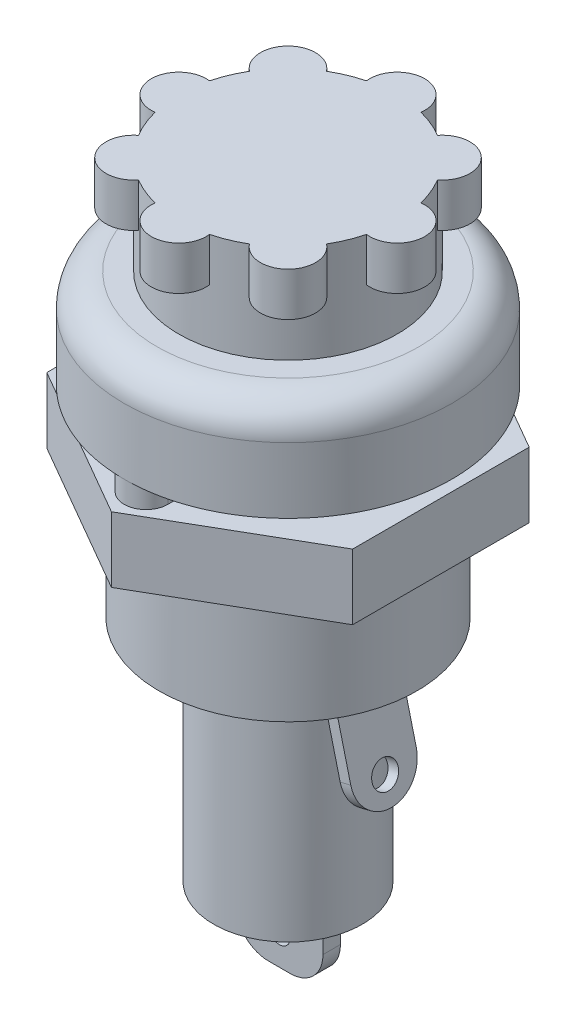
ISO-10303-21;
HEADER;
FILE_DESCRIPTION(('STEP AP214'),'2;1');
FILE_NAME('part.step','',(''),(''),'','','');
FILE_SCHEMA(('AUTOMOTIVE_DESIGN { 1 0 10303 214 1 1 1 1 }'));
ENDSEC;
DATA;
#1=APPLICATION_CONTEXT('core data for automotive mechanical design processes');
#2=APPLICATION_PROTOCOL_DEFINITION('international standard','automotive_design',2000,#1);
#3=PRODUCT_CONTEXT('',#1,'mechanical');
#4=PRODUCT('Part','Part','',(#3));
#5=PRODUCT_RELATED_PRODUCT_CATEGORY('part','',(#4));
#6=PRODUCT_DEFINITION_FORMATION('','',#4);
#7=PRODUCT_DEFINITION_CONTEXT('part definition',#1,'design');
#8=PRODUCT_DEFINITION('design','',#6,#7);
#9=PRODUCT_DEFINITION_SHAPE('','',#8);
#10=(LENGTH_UNIT() NAMED_UNIT(*) SI_UNIT(.MILLI.,.METRE.));
#11=(NAMED_UNIT(*) PLANE_ANGLE_UNIT() SI_UNIT($,.RADIAN.));
#12=(NAMED_UNIT(*) SI_UNIT($,.STERADIAN.) SOLID_ANGLE_UNIT());
#13=UNCERTAINTY_MEASURE_WITH_UNIT(LENGTH_MEASURE(1.E-05),#10,'distance_accuracy_value','');
#14=(GEOMETRIC_REPRESENTATION_CONTEXT(3) GLOBAL_UNCERTAINTY_ASSIGNED_CONTEXT((#13)) GLOBAL_UNIT_ASSIGNED_CONTEXT((#10,
#11,#12)) REPRESENTATION_CONTEXT('',''));
#15=CARTESIAN_POINT('',(0.,0.,0.));
#16=DIRECTION('',(0.,0.,1.));
#17=DIRECTION('',(1.,0.,0.));
#18=AXIS2_PLACEMENT_3D('',#15,#16,#17);
#19=CARTESIAN_POINT('',(0.,28.7,0.));
#20=DIRECTION('',(0.,1.,0.));
#21=DIRECTION('',(-1.,0.,0.));
#22=AXIS2_PLACEMENT_3D('',#19,#20,#21);
#23=CYLINDRICAL_SURFACE('',#22,3.4);
#24=CARTESIAN_POINT('',(0.,0.,0.));
#25=DIRECTION('',(0.,1.,0.));
#26=DIRECTION('',(-1.,0.,0.));
#27=AXIS2_PLACEMENT_3D('',#24,#25,#26);
#28=CIRCLE('',#27,3.4);
#29=CARTESIAN_POINT('',(-3.4,0.,0.));
#30=VERTEX_POINT('',#29);
#31=EDGE_CURVE('E570',#30,#30,#28,.T.);
#32=ORIENTED_EDGE('',*,*,#31,.T.);
#33=EDGE_LOOP('',(#32));
#34=FACE_BOUND('',#33,.T.);
#35=DIRECTION('',(0.,1.,0.));
#36=VECTOR('',#35,1.);
#37=CARTESIAN_POINT('',(3.05122926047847,28.7,1.5));
#38=LINE('',#37,#36);
#39=CARTESIAN_POINT('',(3.05122926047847,10.5,1.5));
#40=VERTEX_POINT('',#39);
#41=CARTESIAN_POINT('',(3.05122926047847,9.99237447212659,1.5));
#42=VERTEX_POINT('',#41);
#43=EDGE_CURVE('E352',#40,#42,#38,.F.);
#44=ORIENTED_EDGE('',*,*,#43,.F.);
#45=CARTESIAN_POINT('',(0.,10.5,0.));
#46=DIRECTION('',(0.,1.,0.));
#47=DIRECTION('',(-1.,0.,0.));
#48=AXIS2_PLACEMENT_3D('',#45,#46,#47);
#49=CIRCLE('',#48,3.4);
#50=CARTESIAN_POINT('',(3.05122926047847,10.5,-1.5));
#51=VERTEX_POINT('',#50);
#52=EDGE_CURVE('E573',#51,#40,#49,.T.);
#53=ORIENTED_EDGE('',*,*,#52,.F.);
#54=DIRECTION('',(0.,1.,0.));
#55=VECTOR('',#54,1.);
#56=CARTESIAN_POINT('',(3.05122926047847,28.7,-1.5));
#57=LINE('',#56,#55);
#58=CARTESIAN_POINT('',(3.05122926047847,9.99237447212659,-1.5));
#59=VERTEX_POINT('',#58);
#60=EDGE_CURVE('E301',#51,#59,#57,.F.);
#61=ORIENTED_EDGE('',*,*,#60,.T.);
#62=CARTESIAN_POINT('',(0.,22.2301866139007,0.));
#63=DIRECTION('',(0.970295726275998,0.241921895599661,0.));
#64=DIRECTION('',(-0.241921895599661,0.970295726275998,0.));
#65=AXIS2_PLACEMENT_3D('',#62,#63,#64);
#66=ELLIPSE('',#65,14.0541226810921,3.4);
#67=EDGE_CURVE('E310',#42,#59,#66,.T.);
#68=ORIENTED_EDGE('',*,*,#67,.F.);
#69=EDGE_LOOP('',(#44,#53,#61,#68));
#70=FACE_BOUND('',#69,.T.);
#71=ADVANCED_FACE('F35',(#34,#70),#23,.T.);
#72=CARTESIAN_POINT('',(3.4,10.5,0.));
#73=DIRECTION('',(0.,1.,0.));
#74=DIRECTION('',(-1.,0.,0.));
#75=AXIS2_PLACEMENT_3D('',#72,#73,#74);
#76=PLANE('',#75);
#77=CARTESIAN_POINT('',(0.,10.5,0.));
#78=DIRECTION('',(0.,1.,0.));
#79=DIRECTION('',(-1.,0.,0.));
#80=AXIS2_PLACEMENT_3D('',#77,#78,#79);
#81=CIRCLE('',#80,5.9);
#82=CARTESIAN_POINT('',(-5.9,10.5,0.));
#83=VERTEX_POINT('',#82);
#84=EDGE_CURVE('E575',#83,#83,#81,.T.);
#85=ORIENTED_EDGE('',*,*,#84,.F.);
#86=EDGE_LOOP('',(#85));
#87=FACE_BOUND('',#86,.T.);
#88=DIRECTION('',(-1.,0.,0.));
#89=VECTOR('',#88,1.);
#90=CARTESIAN_POINT('',(3.4,10.5,1.5));
#91=LINE('',#90,#89);
#92=CARTESIAN_POINT('',(3.43997081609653,10.5,1.5));
#93=VERTEX_POINT('',#92);
#94=EDGE_CURVE('E308',#93,#40,#91,.T.);
#95=ORIENTED_EDGE('',*,*,#94,.F.);
#96=DIRECTION('',(0.,0.,1.));
#97=VECTOR('',#96,1.);
#98=CARTESIAN_POINT('',(3.43997081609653,10.5,0.));
#99=LINE('',#98,#97);
#100=CARTESIAN_POINT('',(3.43997081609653,10.5,-1.5));
#101=VERTEX_POINT('',#100);
#102=EDGE_CURVE('E286',#101,#93,#99,.T.);
#103=ORIENTED_EDGE('',*,*,#102,.F.);
#104=DIRECTION('',(-1.,0.,0.));
#105=VECTOR('',#104,1.);
#106=CARTESIAN_POINT('',(3.4,10.5,-1.5));
#107=LINE('',#106,#105);
#108=EDGE_CURVE('E297',#101,#51,#107,.T.);
#109=ORIENTED_EDGE('',*,*,#108,.T.);
#110=ORIENTED_EDGE('',*,*,#52,.T.);
#111=EDGE_LOOP('',(#95,#103,#109,#110));
#112=FACE_BOUND('',#111,.T.);
#113=ADVANCED_FACE('F307',(#87,#112),#76,.F.);
#114=CARTESIAN_POINT('',(0.,0.,0.));
#115=DIRECTION('',(0.,1.,0.));
#116=DIRECTION('',(-1.,0.,0.));
#117=AXIS2_PLACEMENT_3D('',#114,#115,#116);
#118=PLANE('',#117);
#119=ORIENTED_EDGE('',*,*,#31,.F.);
#120=EDGE_LOOP('',(#119));
#121=FACE_BOUND('',#120,.T.);
#122=DIRECTION('',(0.,0.,-1.));
#123=VECTOR('',#122,1.);
#124=CARTESIAN_POINT('',(-2.,0.,-0.4));
#125=LINE('',#124,#123);
#126=CARTESIAN_POINT('',(-2.,0.,0.4));
#127=VERTEX_POINT('',#126);
#128=CARTESIAN_POINT('',(-2.,0.,-0.4));
#129=VERTEX_POINT('',#128);
#130=EDGE_CURVE('E354',#127,#129,#125,.T.);
#131=ORIENTED_EDGE('',*,*,#130,.F.);
#132=DIRECTION('',(-1.,0.,0.));
#133=VECTOR('',#132,1.);
#134=CARTESIAN_POINT('',(-2.,0.,0.4));
#135=LINE('',#134,#133);
#136=CARTESIAN_POINT('',(2.,0.,0.4));
#137=VERTEX_POINT('',#136);
#138=EDGE_CURVE('E359',#137,#127,#135,.T.);
#139=ORIENTED_EDGE('',*,*,#138,.F.);
#140=DIRECTION('',(0.,0.,1.));
#141=VECTOR('',#140,1.);
#142=CARTESIAN_POINT('',(2.,0.,-0.4));
#143=LINE('',#142,#141);
#144=CARTESIAN_POINT('',(2.,0.,-0.4));
#145=VERTEX_POINT('',#144);
#146=EDGE_CURVE('E368',#145,#137,#143,.T.);
#147=ORIENTED_EDGE('',*,*,#146,.F.);
#148=DIRECTION('',(1.,0.,0.));
#149=VECTOR('',#148,1.);
#150=CARTESIAN_POINT('',(-2.,0.,-0.4));
#151=LINE('',#150,#149);
#152=EDGE_CURVE('E365',#129,#145,#151,.T.);
#153=ORIENTED_EDGE('',*,*,#152,.F.);
#154=EDGE_LOOP('',(#131,#139,#147,#153));
#155=FACE_BOUND('',#154,.T.);
#156=ADVANCED_FACE('F637',(#121,#155),#118,.F.);
#157=CARTESIAN_POINT('',(5.9,19.7,0.));
#158=DIRECTION('',(0.,1.,0.));
#159=DIRECTION('',(-1.,0.,0.));
#160=AXIS2_PLACEMENT_3D('',#157,#158,#159);
#161=PLANE('',#160);
#162=CARTESIAN_POINT('',(0.,19.7,0.));
#163=DIRECTION('',(0.,1.,0.));
#164=DIRECTION('',(-1.,0.,0.));
#165=AXIS2_PLACEMENT_3D('',#162,#163,#164);
#166=CIRCLE('',#165,5.9);
#167=CARTESIAN_POINT('',(-5.9,19.7,0.));
#168=VERTEX_POINT('',#167);
#169=EDGE_CURVE('E578',#168,#168,#166,.T.);
#170=ORIENTED_EDGE('',*,*,#169,.T.);
#171=EDGE_LOOP('',(#170));
#172=FACE_BOUND('',#171,.T.);
#173=CARTESIAN_POINT('',(0.,19.7,6.5));
#174=DIRECTION('',(0.,-1.,0.));
#175=DIRECTION('',(1.,0.,0.));
#176=AXIS2_PLACEMENT_3D('',#173,#174,#175);
#177=CIRCLE('',#176,1.);
#178=CARTESIAN_POINT('',(1.,19.7,6.5));
#179=VERTEX_POINT('',#178);
#180=CARTESIAN_POINT('',(0.,19.7,7.5));
#181=VERTEX_POINT('',#180);
#182=EDGE_CURVE('E395',#179,#181,#177,.T.);
#183=ORIENTED_EDGE('',*,*,#182,.F.);
#184=DIRECTION('',(0.,0.,1.));
#185=VECTOR('',#184,1.);
#186=CARTESIAN_POINT('',(1.,19.7,6.5));
#187=LINE('',#186,#185);
#188=CARTESIAN_POINT('',(1.,19.7,5.91607978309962));
#189=VERTEX_POINT('',#188);
#190=EDGE_CURVE('E385',#189,#179,#187,.T.);
#191=ORIENTED_EDGE('',*,*,#190,.F.);
#192=CARTESIAN_POINT('',(0.,19.7,0.));
#193=DIRECTION('',(0.,1.,0.));
#194=DIRECTION('',(-1.,0.,0.));
#195=AXIS2_PLACEMENT_3D('',#192,#193,#194);
#196=CIRCLE('',#195,5.99999999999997);
#197=CARTESIAN_POINT('',(-0.999999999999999,19.7,5.91607978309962));
#198=VERTEX_POINT('',#197);
#199=EDGE_CURVE('E401',#198,#189,#196,.T.);
#200=ORIENTED_EDGE('',*,*,#199,.F.);
#201=DIRECTION('',(0.,0.,-1.));
#202=VECTOR('',#201,1.);
#203=CARTESIAN_POINT('',(-0.999999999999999,19.7,6.5));
#204=LINE('',#203,#202);
#205=CARTESIAN_POINT('',(-0.999999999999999,19.7,6.5));
#206=VERTEX_POINT('',#205);
#207=EDGE_CURVE('E398',#206,#198,#204,.T.);
#208=ORIENTED_EDGE('',*,*,#207,.F.);
#209=EDGE_CURVE('E380',#181,#206,#177,.T.);
#210=ORIENTED_EDGE('',*,*,#209,.F.);
#211=CARTESIAN_POINT('',(0.,19.7,0.));
#212=DIRECTION('',(0.,1.,0.));
#213=DIRECTION('',(-1.,0.,0.));
#214=AXIS2_PLACEMENT_3D('',#211,#212,#213);
#215=CIRCLE('',#214,7.5);
#216=EDGE_CURVE('E581',#181,#181,#215,.T.);
#217=ORIENTED_EDGE('',*,*,#216,.F.);
#218=EDGE_LOOP('',(#183,#191,#200,#208,#210,#217));
#219=FACE_BOUND('',#218,.T.);
#220=ADVANCED_FACE('F650',(#172,#219),#161,.F.);
#221=CARTESIAN_POINT('',(0.,18.7,8.08290376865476));
#222=DIRECTION('',(0.,1.,0.));
#223=DIRECTION('',(0.,0.,1.));
#224=AXIS2_PLACEMENT_3D('',#221,#222,#223);
#225=PLANE('',#224);
#226=CARTESIAN_POINT('',(0.,18.7,0.));
#227=DIRECTION('',(0.,1.,0.));
#228=DIRECTION('',(0.,0.,1.));
#229=AXIS2_PLACEMENT_3D('',#226,#227,#228);
#230=CIRCLE('',#229,5.9);
#231=CARTESIAN_POINT('',(0.,18.7,5.9));
#232=VERTEX_POINT('',#231);
#233=EDGE_CURVE('E560',#232,#232,#230,.T.);
#234=ORIENTED_EDGE('',*,*,#233,.F.);
#235=EDGE_LOOP('',(#234));
#236=FACE_BOUND('',#235,.T.);
#237=DIRECTION('',(0.866025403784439,0.,0.5));
#238=VECTOR('',#237,1.);
#239=CARTESIAN_POINT('',(-7.,18.7,4.04145188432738));
#240=LINE('',#239,#238);
#241=CARTESIAN_POINT('',(-7.,18.7,4.04145188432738));
#242=VERTEX_POINT('',#241);
#243=CARTESIAN_POINT('',(0.,18.7,8.08290376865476));
#244=VERTEX_POINT('',#243);
#245=EDGE_CURVE('E519',#242,#244,#240,.T.);
#246=ORIENTED_EDGE('',*,*,#245,.T.);
#247=DIRECTION('',(0.866025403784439,0.,-0.5));
#248=VECTOR('',#247,1.);
#249=CARTESIAN_POINT('',(0.,18.7,8.08290376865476));
#250=LINE('',#249,#248);
#251=CARTESIAN_POINT('',(7.,18.7,4.04145188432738));
#252=VERTEX_POINT('',#251);
#253=EDGE_CURVE('E544',#244,#252,#250,.T.);
#254=ORIENTED_EDGE('',*,*,#253,.T.);
#255=DIRECTION('',(0.,0.,-1.));
#256=VECTOR('',#255,1.);
#257=CARTESIAN_POINT('',(7.,18.7,4.04145188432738));
#258=LINE('',#257,#256);
#259=CARTESIAN_POINT('',(7.,18.7,-4.04145188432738));
#260=VERTEX_POINT('',#259);
#261=EDGE_CURVE('E547',#252,#260,#258,.T.);
#262=ORIENTED_EDGE('',*,*,#261,.T.);
#263=DIRECTION('',(-0.866025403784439,0.,-0.5));
#264=VECTOR('',#263,1.);
#265=CARTESIAN_POINT('',(7.,18.7,-4.04145188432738));
#266=LINE('',#265,#264);
#267=CARTESIAN_POINT('',(0.,18.7,-8.08290376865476));
#268=VERTEX_POINT('',#267);
#269=EDGE_CURVE('E550',#260,#268,#266,.T.);
#270=ORIENTED_EDGE('',*,*,#269,.T.);
#271=DIRECTION('',(-0.866025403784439,0.,0.5));
#272=VECTOR('',#271,1.);
#273=CARTESIAN_POINT('',(0.,18.7,-8.08290376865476));
#274=LINE('',#273,#272);
#275=CARTESIAN_POINT('',(-7.,18.7,-4.04145188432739));
#276=VERTEX_POINT('',#275);
#277=EDGE_CURVE('E553',#268,#276,#274,.T.);
#278=ORIENTED_EDGE('',*,*,#277,.T.);
#279=DIRECTION('',(0.,0.,1.));
#280=VECTOR('',#279,1.);
#281=CARTESIAN_POINT('',(-7.,18.7,-4.04145188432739));
#282=LINE('',#281,#280);
#283=EDGE_CURVE('E526',#276,#242,#282,.T.);
#284=ORIENTED_EDGE('',*,*,#283,.T.);
#285=EDGE_LOOP('',(#246,#254,#262,#270,#278,#284));
#286=FACE_BOUND('',#285,.T.);
#287=DIRECTION('',(0.,0.,1.));
#288=VECTOR('',#287,1.);
#289=CARTESIAN_POINT('',(1.,18.7,6.5));
#290=LINE('',#289,#288);
#291=CARTESIAN_POINT('',(1.,18.7,5.91607978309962));
#292=VERTEX_POINT('',#291);
#293=CARTESIAN_POINT('',(1.,18.7,6.5));
#294=VERTEX_POINT('',#293);
#295=EDGE_CURVE('E391',#292,#294,#290,.T.);
#296=ORIENTED_EDGE('',*,*,#295,.T.);
#297=CARTESIAN_POINT('',(0.,18.7,6.5));
#298=DIRECTION('',(0.,-1.,0.));
#299=DIRECTION('',(1.,0.,0.));
#300=AXIS2_PLACEMENT_3D('',#297,#298,#299);
#301=CIRCLE('',#300,1.);
#302=CARTESIAN_POINT('',(-0.999999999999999,18.7,6.5));
#303=VERTEX_POINT('',#302);
#304=EDGE_CURVE('E381',#294,#303,#301,.T.);
#305=ORIENTED_EDGE('',*,*,#304,.T.);
#306=DIRECTION('',(0.,0.,-1.));
#307=VECTOR('',#306,1.);
#308=CARTESIAN_POINT('',(-0.999999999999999,18.7,6.5));
#309=LINE('',#308,#307);
#310=CARTESIAN_POINT('',(-0.999999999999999,18.7,5.91607978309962));
#311=VERTEX_POINT('',#310);
#312=EDGE_CURVE('E384',#303,#311,#309,.T.);
#313=ORIENTED_EDGE('',*,*,#312,.T.);
#314=CARTESIAN_POINT('',(0.,18.7,0.));
#315=DIRECTION('',(0.,1.,0.));
#316=DIRECTION('',(-1.,0.,0.));
#317=AXIS2_PLACEMENT_3D('',#314,#315,#316);
#318=CIRCLE('',#317,5.99999999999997);
#319=EDGE_CURVE('E388',#311,#292,#318,.T.);
#320=ORIENTED_EDGE('',*,*,#319,.T.);
#321=EDGE_LOOP('',(#296,#305,#313,#320));
#322=FACE_BOUND('',#321,.T.);
#323=ADVANCED_FACE('F627',(#236,#286,#322),#225,.T.);
#324=CARTESIAN_POINT('',(5.,28.7,0.));
#325=DIRECTION('',(0.,-1.,0.));
#326=DIRECTION('',(1.,0.,0.));
#327=AXIS2_PLACEMENT_3D('',#324,#325,#326);
#328=PLANE('',#327);
#329=CARTESIAN_POINT('',(0.,28.7,0.));
#330=DIRECTION('',(0.,1.,0.));
#331=DIRECTION('',(-1.,0.,0.));
#332=AXIS2_PLACEMENT_3D('',#329,#330,#331);
#333=CIRCLE('',#332,5.);
#334=CARTESIAN_POINT('',(4.30607172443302,28.7,2.54120961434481));
#335=VERTEX_POINT('',#334);
#336=CARTESIAN_POINT('',(4.8417590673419,28.7,1.24794596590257));
#337=VERTEX_POINT('',#336);
#338=EDGE_CURVE('E588',#335,#337,#333,.T.);
#339=ORIENTED_EDGE('',*,*,#338,.T.);
#340=CARTESIAN_POINT('',(4.99999999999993,28.7,0.));
#341=DIRECTION('',(0.,1.,0.));
#342=DIRECTION('',(0.,0.,1.));
#343=AXIS2_PLACEMENT_3D('',#340,#341,#342);
#344=CIRCLE('',#343,1.25793852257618);
#345=CARTESIAN_POINT('',(4.84175906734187,28.7,-1.24794596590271));
#346=VERTEX_POINT('',#345);
#347=EDGE_CURVE('E493',#337,#346,#344,.T.);
#348=ORIENTED_EDGE('',*,*,#347,.T.);
#349=CARTESIAN_POINT('',(4.30607172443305,28.7,-2.54120961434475));
#350=VERTEX_POINT('',#349);
#351=EDGE_CURVE('E592',#346,#350,#333,.T.);
#352=ORIENTED_EDGE('',*,*,#351,.T.);
#353=CARTESIAN_POINT('',(3.53553390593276,28.7,-3.53553390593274));
#354=DIRECTION('',(0.,1.,0.));
#355=DIRECTION('',(0.,0.,1.));
#356=AXIS2_PLACEMENT_3D('',#353,#354,#355);
#357=CIRCLE('',#356,1.25793852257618);
#358=CARTESIAN_POINT('',(2.54120961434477,28.7,-4.30607172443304));
#359=VERTEX_POINT('',#358);
#360=EDGE_CURVE('E480',#350,#359,#357,.T.);
#361=ORIENTED_EDGE('',*,*,#360,.T.);
#362=CARTESIAN_POINT('',(1.24794596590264,28.7,-4.84175906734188));
#363=VERTEX_POINT('',#362);
#364=EDGE_CURVE('E1223',#359,#363,#333,.T.);
#365=ORIENTED_EDGE('',*,*,#364,.T.);
#366=CARTESIAN_POINT('',(0.,28.7,-5.00000000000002));
#367=DIRECTION('',(0.,1.,0.));
#368=DIRECTION('',(0.,0.,1.));
#369=AXIS2_PLACEMENT_3D('',#366,#367,#368);
#370=CIRCLE('',#369,1.25793852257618);
#371=CARTESIAN_POINT('',(-1.24794596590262,28.7,-4.84175906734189));
#372=VERTEX_POINT('',#371);
#373=EDGE_CURVE('E467',#363,#372,#370,.T.);
#374=ORIENTED_EDGE('',*,*,#373,.T.);
#375=CARTESIAN_POINT('',(-2.54120961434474,28.7,-4.30607172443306));
#376=VERTEX_POINT('',#375);
#377=EDGE_CURVE('E1220',#372,#376,#333,.T.);
#378=ORIENTED_EDGE('',*,*,#377,.T.);
#379=CARTESIAN_POINT('',(-3.53553390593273,28.7,-3.53553390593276));
#380=DIRECTION('',(0.,1.,0.));
#381=DIRECTION('',(0.,0.,1.));
#382=AXIS2_PLACEMENT_3D('',#379,#380,#381);
#383=CIRCLE('',#382,1.25793852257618);
#384=CARTESIAN_POINT('',(-4.30607172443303,28.7,-2.54120961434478));
#385=VERTEX_POINT('',#384);
#386=EDGE_CURVE('E454',#376,#385,#383,.T.);
#387=ORIENTED_EDGE('',*,*,#386,.T.);
#388=CARTESIAN_POINT('',(-4.8417590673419,28.7,-1.24794596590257));
#389=VERTEX_POINT('',#388);
#390=EDGE_CURVE('E1217',#385,#389,#333,.T.);
#391=ORIENTED_EDGE('',*,*,#390,.T.);
#392=CARTESIAN_POINT('',(-5.,28.7,0.));
#393=DIRECTION('',(0.,1.,0.));
#394=DIRECTION('',(0.,0.,1.));
#395=AXIS2_PLACEMENT_3D('',#392,#393,#394);
#396=CIRCLE('',#395,1.25793852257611);
#397=CARTESIAN_POINT('',(-4.84175906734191,28.7,1.24794596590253));
#398=VERTEX_POINT('',#397);
#399=EDGE_CURVE('E441',#389,#398,#396,.T.);
#400=ORIENTED_EDGE('',*,*,#399,.T.);
#401=CARTESIAN_POINT('',(-4.30607172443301,28.7,2.54120961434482));
#402=VERTEX_POINT('',#401);
#403=EDGE_CURVE('E1214',#398,#402,#333,.T.);
#404=ORIENTED_EDGE('',*,*,#403,.T.);
#405=CARTESIAN_POINT('',(-3.53553390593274,28.7,3.53553390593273));
#406=DIRECTION('',(0.,1.,0.));
#407=DIRECTION('',(0.,0.,1.));
#408=AXIS2_PLACEMENT_3D('',#405,#406,#407);
#409=CIRCLE('',#408,1.25793852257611);
#410=CARTESIAN_POINT('',(-2.54120961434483,28.7,4.306071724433));
#411=VERTEX_POINT('',#410);
#412=EDGE_CURVE('E428',#402,#411,#409,.T.);
#413=ORIENTED_EDGE('',*,*,#412,.T.);
#414=CARTESIAN_POINT('',(-1.24794596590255,28.7,4.84175906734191));
#415=VERTEX_POINT('',#414);
#416=EDGE_CURVE('E1212',#411,#415,#333,.T.);
#417=ORIENTED_EDGE('',*,*,#416,.T.);
#418=CARTESIAN_POINT('',(0.,28.7,5.));
#419=DIRECTION('',(0.,1.,0.));
#420=DIRECTION('',(0.,0.,1.));
#421=AXIS2_PLACEMENT_3D('',#418,#419,#420);
#422=CIRCLE('',#421,1.25793852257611);
#423=CARTESIAN_POINT('',(1.24794596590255,28.7,4.84175906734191));
#424=VERTEX_POINT('',#423);
#425=EDGE_CURVE('E417',#415,#424,#422,.T.);
#426=ORIENTED_EDGE('',*,*,#425,.T.);
#427=CARTESIAN_POINT('',(2.54120961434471,28.7,4.30607172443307));
#428=VERTEX_POINT('',#427);
#429=EDGE_CURVE('E587',#424,#428,#333,.T.);
#430=ORIENTED_EDGE('',*,*,#429,.T.);
#431=CARTESIAN_POINT('',(3.5355339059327,28.7,3.53553390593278));
#432=DIRECTION('',(0.,1.,0.));
#433=DIRECTION('',(0.,0.,1.));
#434=AXIS2_PLACEMENT_3D('',#431,#432,#433);
#435=CIRCLE('',#434,1.25793852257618);
#436=EDGE_CURVE('E506',#428,#335,#435,.T.);
#437=ORIENTED_EDGE('',*,*,#436,.T.);
#438=EDGE_LOOP('',(#339,#348,#352,#361,#365,#374,#378,#387,#391,#400,#404,#413,#417,#426,#430,#437));
#439=FACE_BOUND('',#438,.T.);
#440=ADVANCED_FACE('F621',(#439),#328,.F.);
#441=CARTESIAN_POINT('',(0.,28.7,0.));
#442=DIRECTION('',(0.,1.,0.));
#443=DIRECTION('',(-1.,0.,0.));
#444=AXIS2_PLACEMENT_3D('',#441,#442,#443);
#445=CYLINDRICAL_SURFACE('',#444,5.);
#446=ORIENTED_EDGE('',*,*,#429,.F.);
#447=DIRECTION('',(0.,1.,0.));
#448=VECTOR('',#447,1.);
#449=CARTESIAN_POINT('',(1.24794596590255,26.7,4.84175906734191));
#450=LINE('',#449,#448);
#451=CARTESIAN_POINT('',(1.24794596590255,26.7,4.84175906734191));
#452=VERTEX_POINT('',#451);
#453=EDGE_CURVE('E425',#452,#424,#450,.T.);
#454=ORIENTED_EDGE('',*,*,#453,.F.);
#455=CARTESIAN_POINT('',(0.,26.7,0.));
#456=DIRECTION('',(0.,1.,0.));
#457=DIRECTION('',(0.,0.,1.));
#458=AXIS2_PLACEMENT_3D('',#455,#456,#457);
#459=CIRCLE('',#458,5.);
#460=CARTESIAN_POINT('',(-1.24794596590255,26.7,4.84175906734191));
#461=VERTEX_POINT('',#460);
#462=EDGE_CURVE('E418',#461,#452,#459,.T.);
#463=ORIENTED_EDGE('',*,*,#462,.F.);
#464=DIRECTION('',(0.,1.,0.));
#465=VECTOR('',#464,1.);
#466=CARTESIAN_POINT('',(-1.24794596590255,26.7,4.84175906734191));
#467=LINE('',#466,#465);
#468=EDGE_CURVE('E423',#461,#415,#467,.T.);
#469=ORIENTED_EDGE('',*,*,#468,.T.);
#470=ORIENTED_EDGE('',*,*,#416,.F.);
#471=DIRECTION('',(0.,1.,0.));
#472=VECTOR('',#471,1.);
#473=CARTESIAN_POINT('',(-2.54120961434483,26.7,4.306071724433));
#474=LINE('',#473,#472);
#475=CARTESIAN_POINT('',(-2.54120961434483,26.7,4.306071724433));
#476=VERTEX_POINT('',#475);
#477=EDGE_CURVE('E438',#476,#411,#474,.T.);
#478=ORIENTED_EDGE('',*,*,#477,.F.);
#479=CARTESIAN_POINT('',(0.,26.7,0.));
#480=DIRECTION('',(0.,1.,0.));
#481=DIRECTION('',(0.,0.,1.));
#482=AXIS2_PLACEMENT_3D('',#479,#480,#481);
#483=CIRCLE('',#482,5.);
#484=CARTESIAN_POINT('',(-4.30607172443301,26.7,2.54120961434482));
#485=VERTEX_POINT('',#484);
#486=EDGE_CURVE('E431',#485,#476,#483,.T.);
#487=ORIENTED_EDGE('',*,*,#486,.F.);
#488=DIRECTION('',(0.,1.,0.));
#489=VECTOR('',#488,1.);
#490=CARTESIAN_POINT('',(-4.30607172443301,26.7,2.54120961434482));
#491=LINE('',#490,#489);
#492=EDGE_CURVE('E436',#485,#402,#491,.T.);
#493=ORIENTED_EDGE('',*,*,#492,.T.);
#494=ORIENTED_EDGE('',*,*,#403,.F.);
#495=DIRECTION('',(0.,1.,0.));
#496=VECTOR('',#495,1.);
#497=CARTESIAN_POINT('',(-4.84175906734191,26.7,1.24794596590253));
#498=LINE('',#497,#496);
#499=CARTESIAN_POINT('',(-4.84175906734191,26.7,1.24794596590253));
#500=VERTEX_POINT('',#499);
#501=EDGE_CURVE('E451',#500,#398,#498,.T.);
#502=ORIENTED_EDGE('',*,*,#501,.F.);
#503=CARTESIAN_POINT('',(0.,26.7,0.));
#504=DIRECTION('',(0.,1.,0.));
#505=DIRECTION('',(0.,0.,1.));
#506=AXIS2_PLACEMENT_3D('',#503,#504,#505);
#507=CIRCLE('',#506,5.);
#508=CARTESIAN_POINT('',(-4.8417590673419,26.7,-1.24794596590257));
#509=VERTEX_POINT('',#508);
#510=EDGE_CURVE('E444',#509,#500,#507,.T.);
#511=ORIENTED_EDGE('',*,*,#510,.F.);
#512=DIRECTION('',(0.,1.,0.));
#513=VECTOR('',#512,1.);
#514=CARTESIAN_POINT('',(-4.8417590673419,26.7,-1.24794596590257));
#515=LINE('',#514,#513);
#516=EDGE_CURVE('E449',#509,#389,#515,.T.);
#517=ORIENTED_EDGE('',*,*,#516,.T.);
#518=ORIENTED_EDGE('',*,*,#390,.F.);
#519=DIRECTION('',(0.,1.,0.));
#520=VECTOR('',#519,1.);
#521=CARTESIAN_POINT('',(-4.30607172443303,26.7,-2.54120961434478));
#522=LINE('',#521,#520);
#523=CARTESIAN_POINT('',(-4.30607172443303,26.7,-2.54120961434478));
#524=VERTEX_POINT('',#523);
#525=EDGE_CURVE('E464',#524,#385,#522,.T.);
#526=ORIENTED_EDGE('',*,*,#525,.F.);
#527=CARTESIAN_POINT('',(0.,26.7,0.));
#528=DIRECTION('',(0.,1.,0.));
#529=DIRECTION('',(0.,0.,1.));
#530=AXIS2_PLACEMENT_3D('',#527,#528,#529);
#531=CIRCLE('',#530,5.);
#532=CARTESIAN_POINT('',(-2.54120961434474,26.7,-4.30607172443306));
#533=VERTEX_POINT('',#532);
#534=EDGE_CURVE('E457',#533,#524,#531,.T.);
#535=ORIENTED_EDGE('',*,*,#534,.F.);
#536=DIRECTION('',(0.,1.,0.));
#537=VECTOR('',#536,1.);
#538=CARTESIAN_POINT('',(-2.54120961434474,26.7,-4.30607172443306));
#539=LINE('',#538,#537);
#540=EDGE_CURVE('E462',#533,#376,#539,.T.);
#541=ORIENTED_EDGE('',*,*,#540,.T.);
#542=ORIENTED_EDGE('',*,*,#377,.F.);
#543=DIRECTION('',(0.,1.,0.));
#544=VECTOR('',#543,1.);
#545=CARTESIAN_POINT('',(-1.24794596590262,26.7,-4.84175906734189));
#546=LINE('',#545,#544);
#547=CARTESIAN_POINT('',(-1.24794596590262,26.7,-4.84175906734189));
#548=VERTEX_POINT('',#547);
#549=EDGE_CURVE('E477',#548,#372,#546,.T.);
#550=ORIENTED_EDGE('',*,*,#549,.F.);
#551=CARTESIAN_POINT('',(0.,26.7,0.));
#552=DIRECTION('',(0.,1.,0.));
#553=DIRECTION('',(0.,0.,1.));
#554=AXIS2_PLACEMENT_3D('',#551,#552,#553);
#555=CIRCLE('',#554,5.);
#556=CARTESIAN_POINT('',(1.24794596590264,26.7,-4.84175906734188));
#557=VERTEX_POINT('',#556);
#558=EDGE_CURVE('E470',#557,#548,#555,.T.);
#559=ORIENTED_EDGE('',*,*,#558,.F.);
#560=DIRECTION('',(0.,1.,0.));
#561=VECTOR('',#560,1.);
#562=CARTESIAN_POINT('',(1.24794596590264,26.7,-4.84175906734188));
#563=LINE('',#562,#561);
#564=EDGE_CURVE('E475',#557,#363,#563,.T.);
#565=ORIENTED_EDGE('',*,*,#564,.T.);
#566=ORIENTED_EDGE('',*,*,#364,.F.);
#567=DIRECTION('',(0.,1.,0.));
#568=VECTOR('',#567,1.);
#569=CARTESIAN_POINT('',(2.54120961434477,26.7,-4.30607172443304));
#570=LINE('',#569,#568);
#571=CARTESIAN_POINT('',(2.54120961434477,26.7,-4.30607172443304));
#572=VERTEX_POINT('',#571);
#573=EDGE_CURVE('E490',#572,#359,#570,.T.);
#574=ORIENTED_EDGE('',*,*,#573,.F.);
#575=CARTESIAN_POINT('',(0.,26.7,0.));
#576=DIRECTION('',(0.,1.,0.));
#577=DIRECTION('',(0.,0.,1.));
#578=AXIS2_PLACEMENT_3D('',#575,#576,#577);
#579=CIRCLE('',#578,5.);
#580=CARTESIAN_POINT('',(4.30607172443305,26.7,-2.54120961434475));
#581=VERTEX_POINT('',#580);
#582=EDGE_CURVE('E483',#581,#572,#579,.T.);
#583=ORIENTED_EDGE('',*,*,#582,.F.);
#584=DIRECTION('',(0.,1.,0.));
#585=VECTOR('',#584,1.);
#586=CARTESIAN_POINT('',(4.30607172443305,26.7,-2.54120961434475));
#587=LINE('',#586,#585);
#588=EDGE_CURVE('E488',#581,#350,#587,.T.);
#589=ORIENTED_EDGE('',*,*,#588,.T.);
#590=ORIENTED_EDGE('',*,*,#351,.F.);
#591=DIRECTION('',(0.,1.,0.));
#592=VECTOR('',#591,1.);
#593=CARTESIAN_POINT('',(4.84175906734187,26.7,-1.24794596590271));
#594=LINE('',#593,#592);
#595=CARTESIAN_POINT('',(4.84175906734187,26.7,-1.24794596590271));
#596=VERTEX_POINT('',#595);
#597=EDGE_CURVE('E503',#596,#346,#594,.T.);
#598=ORIENTED_EDGE('',*,*,#597,.F.);
#599=CARTESIAN_POINT('',(0.,26.7,0.));
#600=DIRECTION('',(0.,1.,0.));
#601=DIRECTION('',(0.,0.,1.));
#602=AXIS2_PLACEMENT_3D('',#599,#600,#601);
#603=CIRCLE('',#602,5.);
#604=CARTESIAN_POINT('',(4.8417590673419,26.7,1.24794596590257));
#605=VERTEX_POINT('',#604);
#606=EDGE_CURVE('E496',#605,#596,#603,.T.);
#607=ORIENTED_EDGE('',*,*,#606,.F.);
#608=DIRECTION('',(0.,1.,0.));
#609=VECTOR('',#608,1.);
#610=CARTESIAN_POINT('',(4.8417590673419,26.7,1.24794596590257));
#611=LINE('',#610,#609);
#612=EDGE_CURVE('E501',#605,#337,#611,.T.);
#613=ORIENTED_EDGE('',*,*,#612,.T.);
#614=ORIENTED_EDGE('',*,*,#338,.F.);
#615=DIRECTION('',(0.,1.,0.));
#616=VECTOR('',#615,1.);
#617=CARTESIAN_POINT('',(4.30607172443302,26.7,2.54120961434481));
#618=LINE('',#617,#616);
#619=CARTESIAN_POINT('',(4.30607172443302,26.7,2.54120961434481));
#620=VERTEX_POINT('',#619);
#621=EDGE_CURVE('E516',#620,#335,#618,.T.);
#622=ORIENTED_EDGE('',*,*,#621,.F.);
#623=CARTESIAN_POINT('',(0.,26.7,0.));
#624=DIRECTION('',(0.,1.,0.));
#625=DIRECTION('',(0.,0.,1.));
#626=AXIS2_PLACEMENT_3D('',#623,#624,#625);
#627=CIRCLE('',#626,5.);
#628=CARTESIAN_POINT('',(2.54120961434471,26.7,4.30607172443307));
#629=VERTEX_POINT('',#628);
#630=EDGE_CURVE('E509',#629,#620,#627,.T.);
#631=ORIENTED_EDGE('',*,*,#630,.F.);
#632=DIRECTION('',(0.,1.,0.));
#633=VECTOR('',#632,1.);
#634=CARTESIAN_POINT('',(2.54120961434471,26.7,4.30607172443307));
#635=LINE('',#634,#633);
#636=EDGE_CURVE('E514',#629,#428,#635,.T.);
#637=ORIENTED_EDGE('',*,*,#636,.T.);
#638=EDGE_LOOP('',(#446,#454,#463,#469,#470,#478,#487,#493,#494,#502,#511,#517,#518,#526,#535,
#541,#542,#550,#559,#565,#566,#574,#583,#589,#590,#598,#607,#613,#614,#622,#631,#637));
#639=FACE_BOUND('',#638,.T.);
#640=CARTESIAN_POINT('',(0.,24.2,0.));
#641=DIRECTION('',(0.,1.,0.));
#642=DIRECTION('',(-1.,0.,0.));
#643=AXIS2_PLACEMENT_3D('',#640,#641,#642);
#644=CIRCLE('',#643,5.);
#645=CARTESIAN_POINT('',(-5.,24.2,0.));
#646=VERTEX_POINT('',#645);
#647=EDGE_CURVE('E584',#646,#646,#644,.T.);
#648=ORIENTED_EDGE('',*,*,#647,.T.);
#649=EDGE_LOOP('',(#648));
#650=FACE_BOUND('',#649,.T.);
#651=ADVANCED_FACE('F616',(#639,#650),#445,.T.);
#652=CARTESIAN_POINT('',(7.5,24.2,0.));
#653=DIRECTION('',(0.,-1.,0.));
#654=DIRECTION('',(1.,0.,0.));
#655=AXIS2_PLACEMENT_3D('',#652,#653,#654);
#656=PLANE('',#655);
#657=CARTESIAN_POINT('',(0.,24.2,0.));
#658=DIRECTION('',(0.,-1.,0.));
#659=DIRECTION('',(1.,0.,0.));
#660=AXIS2_PLACEMENT_3D('',#657,#658,#659);
#661=CIRCLE('',#660,6.);
#662=CARTESIAN_POINT('',(6.,24.2,0.));
#663=VERTEX_POINT('',#662);
#664=EDGE_CURVE('E597',#663,#663,#661,.F.);
#665=ORIENTED_EDGE('',*,*,#664,.T.);
#666=EDGE_LOOP('',(#665));
#667=FACE_BOUND('',#666,.T.);
#668=ORIENTED_EDGE('',*,*,#647,.F.);
#669=EDGE_LOOP('',(#668));
#670=FACE_BOUND('',#669,.T.);
#671=ADVANCED_FACE('F613',(#667,#670),#656,.F.);
#672=CARTESIAN_POINT('',(0.,28.7,0.));
#673=DIRECTION('',(0.,1.,0.));
#674=DIRECTION('',(-1.,0.,0.));
#675=AXIS2_PLACEMENT_3D('',#672,#673,#674);
#676=CYLINDRICAL_SURFACE('',#675,7.5);
#677=CARTESIAN_POINT('',(0.,22.7,0.));
#678=DIRECTION('',(0.,-1.,0.));
#679=DIRECTION('',(1.,0.,0.));
#680=AXIS2_PLACEMENT_3D('',#677,#678,#679);
#681=CIRCLE('',#680,7.5);
#682=CARTESIAN_POINT('',(7.5,22.7,0.));
#683=VERTEX_POINT('',#682);
#684=EDGE_CURVE('E305',#683,#683,#681,.T.);
#685=ORIENTED_EDGE('',*,*,#684,.T.);
#686=EDGE_LOOP('',(#685));
#687=FACE_BOUND('',#686,.T.);
#688=ORIENTED_EDGE('',*,*,#216,.T.);
#689=EDGE_LOOP('',(#688));
#690=FACE_BOUND('',#689,.T.);
#691=ADVANCED_FACE('F602',(#687,#690),#676,.T.);
#692=CARTESIAN_POINT('',(0.,28.7,0.));
#693=DIRECTION('',(0.,1.,0.));
#694=DIRECTION('',(-1.,0.,0.));
#695=AXIS2_PLACEMENT_3D('',#692,#693,#694);
#696=CYLINDRICAL_SURFACE('',#695,5.9);
#697=ORIENTED_EDGE('',*,*,#233,.T.);
#698=EDGE_LOOP('',(#697));
#699=FACE_BOUND('',#698,.T.);
#700=ORIENTED_EDGE('',*,*,#169,.F.);
#701=EDGE_LOOP('',(#700));
#702=FACE_BOUND('',#701,.T.);
#703=ADVANCED_FACE('F644',(#699,#702),#696,.T.);
#704=CARTESIAN_POINT('',(0.,15.7,8.08290376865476));
#705=DIRECTION('',(0.,1.,0.));
#706=DIRECTION('',(0.,0.,1.));
#707=AXIS2_PLACEMENT_3D('',#704,#705,#706);
#708=PLANE('',#707);
#709=DIRECTION('',(0.866025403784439,0.,0.5));
#710=VECTOR('',#709,1.);
#711=CARTESIAN_POINT('',(-7.,15.7,4.04145188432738));
#712=LINE('',#711,#710);
#713=CARTESIAN_POINT('',(-7.,15.7,4.04145188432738));
#714=VERTEX_POINT('',#713);
#715=CARTESIAN_POINT('',(0.,15.7,8.08290376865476));
#716=VERTEX_POINT('',#715);
#717=EDGE_CURVE('E522',#714,#716,#712,.T.);
#718=ORIENTED_EDGE('',*,*,#717,.F.);
#719=DIRECTION('',(0.,0.,1.));
#720=VECTOR('',#719,1.);
#721=CARTESIAN_POINT('',(-7.,15.7,-4.04145188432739));
#722=LINE('',#721,#720);
#723=CARTESIAN_POINT('',(-7.,15.7,-4.04145188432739));
#724=VERTEX_POINT('',#723);
#725=EDGE_CURVE('E538',#724,#714,#722,.T.);
#726=ORIENTED_EDGE('',*,*,#725,.F.);
#727=DIRECTION('',(-0.866025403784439,0.,0.5));
#728=VECTOR('',#727,1.);
#729=CARTESIAN_POINT('',(0.,15.7,-8.08290376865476));
#730=LINE('',#729,#728);
#731=CARTESIAN_POINT('',(0.,15.7,-8.08290376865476));
#732=VERTEX_POINT('',#731);
#733=EDGE_CURVE('E535',#732,#724,#730,.T.);
#734=ORIENTED_EDGE('',*,*,#733,.F.);
#735=DIRECTION('',(-0.866025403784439,0.,-0.5));
#736=VECTOR('',#735,1.);
#737=CARTESIAN_POINT('',(7.,15.7,-4.04145188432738));
#738=LINE('',#737,#736);
#739=CARTESIAN_POINT('',(7.,15.7,-4.04145188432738));
#740=VERTEX_POINT('',#739);
#741=EDGE_CURVE('E532',#740,#732,#738,.T.);
#742=ORIENTED_EDGE('',*,*,#741,.F.);
#743=DIRECTION('',(0.,0.,-1.));
#744=VECTOR('',#743,1.);
#745=CARTESIAN_POINT('',(7.,15.7,4.04145188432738));
#746=LINE('',#745,#744);
#747=CARTESIAN_POINT('',(7.,15.7,4.04145188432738));
#748=VERTEX_POINT('',#747);
#749=EDGE_CURVE('E529',#748,#740,#746,.T.);
#750=ORIENTED_EDGE('',*,*,#749,.F.);
#751=DIRECTION('',(0.866025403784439,0.,-0.5));
#752=VECTOR('',#751,1.);
#753=CARTESIAN_POINT('',(0.,15.7,8.08290376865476));
#754=LINE('',#753,#752);
#755=EDGE_CURVE('E525',#716,#748,#754,.T.);
#756=ORIENTED_EDGE('',*,*,#755,.F.);
#757=EDGE_LOOP('',(#718,#726,#734,#742,#750,#756));
#758=FACE_BOUND('',#757,.T.);
#759=CARTESIAN_POINT('',(0.,15.7,0.));
#760=DIRECTION('',(0.,1.,0.));
#761=DIRECTION('',(0.,0.,1.));
#762=AXIS2_PLACEMENT_3D('',#759,#760,#761);
#763=CIRCLE('',#762,5.9);
#764=CARTESIAN_POINT('',(0.,15.7,5.9));
#765=VERTEX_POINT('',#764);
#766=EDGE_CURVE('E591',#765,#765,#763,.T.);
#767=ORIENTED_EDGE('',*,*,#766,.T.);
#768=EDGE_LOOP('',(#767));
#769=FACE_BOUND('',#768,.T.);
#770=ADVANCED_FACE('F647',(#758,#769),#708,.F.);
#771=CARTESIAN_POINT('',(-7.,15.7,4.04145188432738));
#772=DIRECTION('',(-0.5,0.,0.866025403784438));
#773=DIRECTION('',(0.866025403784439,0.,0.5));
#774=AXIS2_PLACEMENT_3D('',#771,#772,#773);
#775=PLANE('',#774);
#776=ORIENTED_EDGE('',*,*,#245,.F.);
#777=DIRECTION('',(0.,1.,0.));
#778=VECTOR('',#777,1.);
#779=CARTESIAN_POINT('',(-7.,15.7,4.04145188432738));
#780=LINE('',#779,#778);
#781=EDGE_CURVE('E558',#714,#242,#780,.T.);
#782=ORIENTED_EDGE('',*,*,#781,.F.);
#783=ORIENTED_EDGE('',*,*,#717,.T.);
#784=DIRECTION('',(0.,1.,0.));
#785=VECTOR('',#784,1.);
#786=CARTESIAN_POINT('',(0.,15.7,8.08290376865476));
#787=LINE('',#786,#785);
#788=EDGE_CURVE('E541',#716,#244,#787,.T.);
#789=ORIENTED_EDGE('',*,*,#788,.T.);
#790=EDGE_LOOP('',(#776,#782,#783,#789));
#791=FACE_BOUND('',#790,.T.);
#792=ADVANCED_FACE('F671',(#791),#775,.T.);
#793=CARTESIAN_POINT('',(-7.,15.7,-4.04145188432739));
#794=DIRECTION('',(-1.,0.,0.));
#795=DIRECTION('',(0.,0.,1.));
#796=AXIS2_PLACEMENT_3D('',#793,#794,#795);
#797=PLANE('',#796);
#798=ORIENTED_EDGE('',*,*,#283,.F.);
#799=DIRECTION('',(0.,1.,0.));
#800=VECTOR('',#799,1.);
#801=CARTESIAN_POINT('',(-7.,15.7,-4.04145188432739));
#802=LINE('',#801,#800);
#803=EDGE_CURVE('E561',#724,#276,#802,.T.);
#804=ORIENTED_EDGE('',*,*,#803,.F.);
#805=ORIENTED_EDGE('',*,*,#725,.T.);
#806=ORIENTED_EDGE('',*,*,#781,.T.);
#807=EDGE_LOOP('',(#798,#804,#805,#806));
#808=FACE_BOUND('',#807,.T.);
#809=ADVANCED_FACE('F679',(#808),#797,.T.);
#810=CARTESIAN_POINT('',(0.,15.7,-8.08290376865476));
#811=DIRECTION('',(-0.5,0.,-0.866025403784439));
#812=DIRECTION('',(-0.866025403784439,0.,0.5));
#813=AXIS2_PLACEMENT_3D('',#810,#811,#812);
#814=PLANE('',#813);
#815=ORIENTED_EDGE('',*,*,#277,.F.);
#816=DIRECTION('',(0.,1.,0.));
#817=VECTOR('',#816,1.);
#818=CARTESIAN_POINT('',(0.,15.7,-8.08290376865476));
#819=LINE('',#818,#817);
#820=EDGE_CURVE('E563',#732,#268,#819,.T.);
#821=ORIENTED_EDGE('',*,*,#820,.F.);
#822=ORIENTED_EDGE('',*,*,#733,.T.);
#823=ORIENTED_EDGE('',*,*,#803,.T.);
#824=EDGE_LOOP('',(#815,#821,#822,#823));
#825=FACE_BOUND('',#824,.T.);
#826=ADVANCED_FACE('F686',(#825),#814,.T.);
#827=CARTESIAN_POINT('',(7.,15.7,-4.04145188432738));
#828=DIRECTION('',(0.5,0.,-0.866025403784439));
#829=DIRECTION('',(-0.866025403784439,0.,-0.5));
#830=AXIS2_PLACEMENT_3D('',#827,#828,#829);
#831=PLANE('',#830);
#832=ORIENTED_EDGE('',*,*,#269,.F.);
#833=DIRECTION('',(0.,1.,0.));
#834=VECTOR('',#833,1.);
#835=CARTESIAN_POINT('',(7.,15.7,-4.04145188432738));
#836=LINE('',#835,#834);
#837=EDGE_CURVE('E565',#740,#260,#836,.T.);
#838=ORIENTED_EDGE('',*,*,#837,.F.);
#839=ORIENTED_EDGE('',*,*,#741,.T.);
#840=ORIENTED_EDGE('',*,*,#820,.T.);
#841=EDGE_LOOP('',(#832,#838,#839,#840));
#842=FACE_BOUND('',#841,.T.);
#843=ADVANCED_FACE('F694',(#842),#831,.T.);
#844=CARTESIAN_POINT('',(7.,15.7,4.04145188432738));
#845=DIRECTION('',(1.,0.,0.));
#846=DIRECTION('',(0.,0.,-1.));
#847=AXIS2_PLACEMENT_3D('',#844,#845,#846);
#848=PLANE('',#847);
#849=ORIENTED_EDGE('',*,*,#261,.F.);
#850=DIRECTION('',(0.,1.,0.));
#851=VECTOR('',#850,1.);
#852=CARTESIAN_POINT('',(7.,15.7,4.04145188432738));
#853=LINE('',#852,#851);
#854=EDGE_CURVE('E567',#748,#252,#853,.T.);
#855=ORIENTED_EDGE('',*,*,#854,.F.);
#856=ORIENTED_EDGE('',*,*,#749,.T.);
#857=ORIENTED_EDGE('',*,*,#837,.T.);
#858=EDGE_LOOP('',(#849,#855,#856,#857));
#859=FACE_BOUND('',#858,.T.);
#860=ADVANCED_FACE('F702',(#859),#848,.T.);
#861=CARTESIAN_POINT('',(0.,15.7,8.08290376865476));
#862=DIRECTION('',(0.5,0.,0.866025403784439));
#863=DIRECTION('',(0.866025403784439,0.,-0.5));
#864=AXIS2_PLACEMENT_3D('',#861,#862,#863);
#865=PLANE('',#864);
#866=ORIENTED_EDGE('',*,*,#253,.F.);
#867=ORIENTED_EDGE('',*,*,#788,.F.);
#868=ORIENTED_EDGE('',*,*,#755,.T.);
#869=ORIENTED_EDGE('',*,*,#854,.T.);
#870=EDGE_LOOP('',(#866,#867,#868,#869));
#871=FACE_BOUND('',#870,.T.);
#872=ADVANCED_FACE('F710',(#871),#865,.T.);
#873=ORIENTED_EDGE('',*,*,#84,.T.);
#874=EDGE_LOOP('',(#873));
#875=FACE_BOUND('',#874,.T.);
#876=ORIENTED_EDGE('',*,*,#766,.F.);
#877=EDGE_LOOP('',(#876));
#878=FACE_BOUND('',#877,.T.);
#879=ADVANCED_FACE('F649',(#875,#878),#696,.T.);
#880=CARTESIAN_POINT('',(3.5355339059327,26.7,3.53553390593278));
#881=DIRECTION('',(0.,1.,0.));
#882=DIRECTION('',(-1.,0.,0.));
#883=AXIS2_PLACEMENT_3D('',#880,#881,#882);
#884=CYLINDRICAL_SURFACE('',#883,1.25793852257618);
#885=ORIENTED_EDGE('',*,*,#436,.F.);
#886=ORIENTED_EDGE('',*,*,#636,.F.);
#887=CARTESIAN_POINT('',(3.5355339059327,26.7,3.53553390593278));
#888=DIRECTION('',(0.,1.,0.));
#889=DIRECTION('',(0.,0.,1.));
#890=AXIS2_PLACEMENT_3D('',#887,#888,#889);
#891=CIRCLE('',#890,1.25793852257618);
#892=EDGE_CURVE('E511',#629,#620,#891,.T.);
#893=ORIENTED_EDGE('',*,*,#892,.T.);
#894=ORIENTED_EDGE('',*,*,#621,.T.);
#895=EDGE_LOOP('',(#885,#886,#893,#894));
#896=FACE_BOUND('',#895,.T.);
#897=ADVANCED_FACE('F725',(#896),#884,.T.);
#898=CARTESIAN_POINT('',(0.,26.7,0.));
#899=DIRECTION('',(0.,1.,0.));
#900=DIRECTION('',(0.,0.,1.));
#901=AXIS2_PLACEMENT_3D('',#898,#899,#900);
#902=PLANE('',#901);
#903=ORIENTED_EDGE('',*,*,#630,.T.);
#904=ORIENTED_EDGE('',*,*,#892,.F.);
#905=EDGE_LOOP('',(#903,#904));
#906=FACE_BOUND('',#905,.T.);
#907=ADVANCED_FACE('F733',(#906),#902,.F.);
#908=CARTESIAN_POINT('',(4.99999999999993,26.7,0.));
#909=DIRECTION('',(0.,1.,0.));
#910=DIRECTION('',(-1.,0.,0.));
#911=AXIS2_PLACEMENT_3D('',#908,#909,#910);
#912=CYLINDRICAL_SURFACE('',#911,1.25793852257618);
#913=ORIENTED_EDGE('',*,*,#347,.F.);
#914=ORIENTED_EDGE('',*,*,#612,.F.);
#915=CARTESIAN_POINT('',(4.99999999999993,26.7,0.));
#916=DIRECTION('',(0.,1.,0.));
#917=DIRECTION('',(0.,0.,1.));
#918=AXIS2_PLACEMENT_3D('',#915,#916,#917);
#919=CIRCLE('',#918,1.25793852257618);
#920=EDGE_CURVE('E498',#605,#596,#919,.T.);
#921=ORIENTED_EDGE('',*,*,#920,.T.);
#922=ORIENTED_EDGE('',*,*,#597,.T.);
#923=EDGE_LOOP('',(#913,#914,#921,#922));
#924=FACE_BOUND('',#923,.T.);
#925=ADVANCED_FACE('F741',(#924),#912,.T.);
#926=CARTESIAN_POINT('',(0.,26.7,0.));
#927=DIRECTION('',(0.,1.,0.));
#928=DIRECTION('',(0.,0.,1.));
#929=AXIS2_PLACEMENT_3D('',#926,#927,#928);
#930=PLANE('',#929);
#931=ORIENTED_EDGE('',*,*,#606,.T.);
#932=ORIENTED_EDGE('',*,*,#920,.F.);
#933=EDGE_LOOP('',(#931,#932));
#934=FACE_BOUND('',#933,.T.);
#935=ADVANCED_FACE('F749',(#934),#930,.F.);
#936=CARTESIAN_POINT('',(3.53553390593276,26.7,-3.53553390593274));
#937=DIRECTION('',(0.,1.,0.));
#938=DIRECTION('',(-1.,0.,0.));
#939=AXIS2_PLACEMENT_3D('',#936,#937,#938);
#940=CYLINDRICAL_SURFACE('',#939,1.25793852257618);
#941=ORIENTED_EDGE('',*,*,#360,.F.);
#942=ORIENTED_EDGE('',*,*,#588,.F.);
#943=CARTESIAN_POINT('',(3.53553390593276,26.7,-3.53553390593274));
#944=DIRECTION('',(0.,1.,0.));
#945=DIRECTION('',(0.,0.,1.));
#946=AXIS2_PLACEMENT_3D('',#943,#944,#945);
#947=CIRCLE('',#946,1.25793852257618);
#948=EDGE_CURVE('E485',#581,#572,#947,.T.);
#949=ORIENTED_EDGE('',*,*,#948,.T.);
#950=ORIENTED_EDGE('',*,*,#573,.T.);
#951=EDGE_LOOP('',(#941,#942,#949,#950));
#952=FACE_BOUND('',#951,.T.);
#953=ADVANCED_FACE('F757',(#952),#940,.T.);
#954=CARTESIAN_POINT('',(0.,26.7,0.));
#955=DIRECTION('',(0.,1.,0.));
#956=DIRECTION('',(0.,0.,1.));
#957=AXIS2_PLACEMENT_3D('',#954,#955,#956);
#958=PLANE('',#957);
#959=ORIENTED_EDGE('',*,*,#582,.T.);
#960=ORIENTED_EDGE('',*,*,#948,.F.);
#961=EDGE_LOOP('',(#959,#960));
#962=FACE_BOUND('',#961,.T.);
#963=ADVANCED_FACE('F765',(#962),#958,.F.);
#964=CARTESIAN_POINT('',(0.,26.7,-5.00000000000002));
#965=DIRECTION('',(0.,1.,0.));
#966=DIRECTION('',(-1.,0.,0.));
#967=AXIS2_PLACEMENT_3D('',#964,#965,#966);
#968=CYLINDRICAL_SURFACE('',#967,1.25793852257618);
#969=ORIENTED_EDGE('',*,*,#373,.F.);
#970=ORIENTED_EDGE('',*,*,#564,.F.);
#971=CARTESIAN_POINT('',(0.,26.7,-5.00000000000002));
#972=DIRECTION('',(0.,1.,0.));
#973=DIRECTION('',(0.,0.,1.));
#974=AXIS2_PLACEMENT_3D('',#971,#972,#973);
#975=CIRCLE('',#974,1.25793852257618);
#976=EDGE_CURVE('E472',#557,#548,#975,.T.);
#977=ORIENTED_EDGE('',*,*,#976,.T.);
#978=ORIENTED_EDGE('',*,*,#549,.T.);
#979=EDGE_LOOP('',(#969,#970,#977,#978));
#980=FACE_BOUND('',#979,.T.);
#981=ADVANCED_FACE('F773',(#980),#968,.T.);
#982=CARTESIAN_POINT('',(0.,26.7,0.));
#983=DIRECTION('',(0.,1.,0.));
#984=DIRECTION('',(0.,0.,1.));
#985=AXIS2_PLACEMENT_3D('',#982,#983,#984);
#986=PLANE('',#985);
#987=ORIENTED_EDGE('',*,*,#558,.T.);
#988=ORIENTED_EDGE('',*,*,#976,.F.);
#989=EDGE_LOOP('',(#987,#988));
#990=FACE_BOUND('',#989,.T.);
#991=ADVANCED_FACE('F781',(#990),#986,.F.);
#992=CARTESIAN_POINT('',(-3.53553390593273,26.7,-3.53553390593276));
#993=DIRECTION('',(0.,1.,0.));
#994=DIRECTION('',(-1.,0.,0.));
#995=AXIS2_PLACEMENT_3D('',#992,#993,#994);
#996=CYLINDRICAL_SURFACE('',#995,1.25793852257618);
#997=ORIENTED_EDGE('',*,*,#386,.F.);
#998=ORIENTED_EDGE('',*,*,#540,.F.);
#999=CARTESIAN_POINT('',(-3.53553390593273,26.7,-3.53553390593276));
#1000=DIRECTION('',(0.,1.,0.));
#1001=DIRECTION('',(0.,0.,1.));
#1002=AXIS2_PLACEMENT_3D('',#999,#1000,#1001);
#1003=CIRCLE('',#1002,1.25793852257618);
#1004=EDGE_CURVE('E459',#533,#524,#1003,.T.);
#1005=ORIENTED_EDGE('',*,*,#1004,.T.);
#1006=ORIENTED_EDGE('',*,*,#525,.T.);
#1007=EDGE_LOOP('',(#997,#998,#1005,#1006));
#1008=FACE_BOUND('',#1007,.T.);
#1009=ADVANCED_FACE('F789',(#1008),#996,.T.);
#1010=CARTESIAN_POINT('',(0.,26.7,0.));
#1011=DIRECTION('',(0.,1.,0.));
#1012=DIRECTION('',(0.,0.,1.));
#1013=AXIS2_PLACEMENT_3D('',#1010,#1011,#1012);
#1014=PLANE('',#1013);
#1015=ORIENTED_EDGE('',*,*,#534,.T.);
#1016=ORIENTED_EDGE('',*,*,#1004,.F.);
#1017=EDGE_LOOP('',(#1015,#1016));
#1018=FACE_BOUND('',#1017,.T.);
#1019=ADVANCED_FACE('F797',(#1018),#1014,.F.);
#1020=CARTESIAN_POINT('',(-5.,26.7,0.));
#1021=DIRECTION('',(0.,1.,0.));
#1022=DIRECTION('',(-1.,0.,0.));
#1023=AXIS2_PLACEMENT_3D('',#1020,#1021,#1022);
#1024=CYLINDRICAL_SURFACE('',#1023,1.25793852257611);
#1025=ORIENTED_EDGE('',*,*,#399,.F.);
#1026=ORIENTED_EDGE('',*,*,#516,.F.);
#1027=CARTESIAN_POINT('',(-5.,26.7,0.));
#1028=DIRECTION('',(0.,1.,0.));
#1029=DIRECTION('',(0.,0.,1.));
#1030=AXIS2_PLACEMENT_3D('',#1027,#1028,#1029);
#1031=CIRCLE('',#1030,1.25793852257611);
#1032=EDGE_CURVE('E446',#509,#500,#1031,.T.);
#1033=ORIENTED_EDGE('',*,*,#1032,.T.);
#1034=ORIENTED_EDGE('',*,*,#501,.T.);
#1035=EDGE_LOOP('',(#1025,#1026,#1033,#1034));
#1036=FACE_BOUND('',#1035,.T.);
#1037=ADVANCED_FACE('F805',(#1036),#1024,.T.);
#1038=CARTESIAN_POINT('',(0.,26.7,0.));
#1039=DIRECTION('',(0.,1.,0.));
#1040=DIRECTION('',(0.,0.,1.));
#1041=AXIS2_PLACEMENT_3D('',#1038,#1039,#1040);
#1042=PLANE('',#1041);
#1043=ORIENTED_EDGE('',*,*,#510,.T.);
#1044=ORIENTED_EDGE('',*,*,#1032,.F.);
#1045=EDGE_LOOP('',(#1043,#1044));
#1046=FACE_BOUND('',#1045,.T.);
#1047=ADVANCED_FACE('F813',(#1046),#1042,.F.);
#1048=CARTESIAN_POINT('',(-3.53553390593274,26.7,3.53553390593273));
#1049=DIRECTION('',(0.,1.,0.));
#1050=DIRECTION('',(-1.,0.,0.));
#1051=AXIS2_PLACEMENT_3D('',#1048,#1049,#1050);
#1052=CYLINDRICAL_SURFACE('',#1051,1.25793852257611);
#1053=ORIENTED_EDGE('',*,*,#412,.F.);
#1054=ORIENTED_EDGE('',*,*,#492,.F.);
#1055=CARTESIAN_POINT('',(-3.53553390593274,26.7,3.53553390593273));
#1056=DIRECTION('',(0.,1.,0.));
#1057=DIRECTION('',(0.,0.,1.));
#1058=AXIS2_PLACEMENT_3D('',#1055,#1056,#1057);
#1059=CIRCLE('',#1058,1.25793852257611);
#1060=EDGE_CURVE('E433',#485,#476,#1059,.T.);
#1061=ORIENTED_EDGE('',*,*,#1060,.T.);
#1062=ORIENTED_EDGE('',*,*,#477,.T.);
#1063=EDGE_LOOP('',(#1053,#1054,#1061,#1062));
#1064=FACE_BOUND('',#1063,.T.);
#1065=ADVANCED_FACE('F821',(#1064),#1052,.T.);
#1066=CARTESIAN_POINT('',(0.,26.7,0.));
#1067=DIRECTION('',(0.,1.,0.));
#1068=DIRECTION('',(0.,0.,1.));
#1069=AXIS2_PLACEMENT_3D('',#1066,#1067,#1068);
#1070=PLANE('',#1069);
#1071=ORIENTED_EDGE('',*,*,#486,.T.);
#1072=ORIENTED_EDGE('',*,*,#1060,.F.);
#1073=EDGE_LOOP('',(#1071,#1072));
#1074=FACE_BOUND('',#1073,.T.);
#1075=ADVANCED_FACE('F829',(#1074),#1070,.F.);
#1076=CARTESIAN_POINT('',(0.,26.7,5.));
#1077=DIRECTION('',(0.,1.,0.));
#1078=DIRECTION('',(-1.,0.,0.));
#1079=AXIS2_PLACEMENT_3D('',#1076,#1077,#1078);
#1080=CYLINDRICAL_SURFACE('',#1079,1.25793852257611);
#1081=ORIENTED_EDGE('',*,*,#425,.F.);
#1082=ORIENTED_EDGE('',*,*,#468,.F.);
#1083=CARTESIAN_POINT('',(0.,26.7,5.));
#1084=DIRECTION('',(0.,1.,0.));
#1085=DIRECTION('',(0.,0.,1.));
#1086=AXIS2_PLACEMENT_3D('',#1083,#1084,#1085);
#1087=CIRCLE('',#1086,1.25793852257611);
#1088=EDGE_CURVE('E420',#461,#452,#1087,.T.);
#1089=ORIENTED_EDGE('',*,*,#1088,.T.);
#1090=ORIENTED_EDGE('',*,*,#453,.T.);
#1091=EDGE_LOOP('',(#1081,#1082,#1089,#1090));
#1092=FACE_BOUND('',#1091,.T.);
#1093=ADVANCED_FACE('F837',(#1092),#1080,.T.);
#1094=CARTESIAN_POINT('',(0.,26.7,0.));
#1095=DIRECTION('',(0.,1.,0.));
#1096=DIRECTION('',(0.,0.,1.));
#1097=AXIS2_PLACEMENT_3D('',#1094,#1095,#1096);
#1098=PLANE('',#1097);
#1099=ORIENTED_EDGE('',*,*,#462,.T.);
#1100=ORIENTED_EDGE('',*,*,#1088,.F.);
#1101=EDGE_LOOP('',(#1099,#1100));
#1102=FACE_BOUND('',#1101,.T.);
#1103=ADVANCED_FACE('F609',(#1102),#1098,.F.);
#1104=CARTESIAN_POINT('',(0.,22.7,0.));
#1105=DIRECTION('',(0.,-1.,0.));
#1106=DIRECTION('',(1.,0.,0.));
#1107=AXIS2_PLACEMENT_3D('',#1104,#1105,#1106);
#1108=TOROIDAL_SURFACE('',#1107,6.,1.5);
#1109=ORIENTED_EDGE('',*,*,#684,.F.);
#1110=EDGE_LOOP('',(#1109));
#1111=FACE_BOUND('',#1110,.T.);
#1112=ORIENTED_EDGE('',*,*,#664,.F.);
#1113=EDGE_LOOP('',(#1112));
#1114=FACE_BOUND('',#1113,.T.);
#1115=ADVANCED_FACE('F605',(#1111,#1114),#1108,.T.);
#1116=CARTESIAN_POINT('',(0.,18.7,6.5));
#1117=DIRECTION('',(0.,1.,0.));
#1118=DIRECTION('',(-1.,0.,0.));
#1119=AXIS2_PLACEMENT_3D('',#1116,#1117,#1118);
#1120=CYLINDRICAL_SURFACE('',#1119,1.);
#1121=ORIENTED_EDGE('',*,*,#182,.T.);
#1122=ORIENTED_EDGE('',*,*,#209,.T.);
#1123=DIRECTION('',(0.,1.,0.));
#1124=VECTOR('',#1123,1.);
#1125=CARTESIAN_POINT('',(-0.999999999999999,18.7,6.5));
#1126=LINE('',#1125,#1124);
#1127=EDGE_CURVE('E414',#303,#206,#1126,.T.);
#1128=ORIENTED_EDGE('',*,*,#1127,.F.);
#1129=ORIENTED_EDGE('',*,*,#304,.F.);
#1130=DIRECTION('',(0.,1.,0.));
#1131=VECTOR('',#1130,1.);
#1132=CARTESIAN_POINT('',(1.,18.7,6.5));
#1133=LINE('',#1132,#1131);
#1134=EDGE_CURVE('E394',#294,#179,#1133,.T.);
#1135=ORIENTED_EDGE('',*,*,#1134,.T.);
#1136=EDGE_LOOP('',(#1121,#1122,#1128,#1129,#1135));
#1137=FACE_BOUND('',#1136,.T.);
#1138=ADVANCED_FACE('F608',(#1137),#1120,.T.);
#1139=CARTESIAN_POINT('',(-0.999999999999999,18.7,6.5));
#1140=DIRECTION('',(1.,0.,0.));
#1141=DIRECTION('',(0.,1.,0.));
#1142=AXIS2_PLACEMENT_3D('',#1139,#1140,#1141);
#1143=PLANE('',#1142);
#1144=ORIENTED_EDGE('',*,*,#207,.T.);
#1145=DIRECTION('',(0.,1.,0.));
#1146=VECTOR('',#1145,1.);
#1147=CARTESIAN_POINT('',(-0.999999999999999,18.7,5.91607978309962));
#1148=LINE('',#1147,#1146);
#1149=EDGE_CURVE('E411',#311,#198,#1148,.T.);
#1150=ORIENTED_EDGE('',*,*,#1149,.F.);
#1151=ORIENTED_EDGE('',*,*,#312,.F.);
#1152=ORIENTED_EDGE('',*,*,#1127,.T.);
#1153=EDGE_LOOP('',(#1144,#1150,#1151,#1152));
#1154=FACE_BOUND('',#1153,.T.);
#1155=ADVANCED_FACE('F863',(#1154),#1143,.F.);
#1156=CARTESIAN_POINT('',(0.,18.7,0.));
#1157=DIRECTION('',(0.,1.,0.));
#1158=DIRECTION('',(-1.,0.,0.));
#1159=AXIS2_PLACEMENT_3D('',#1156,#1157,#1158);
#1160=CYLINDRICAL_SURFACE('',#1159,5.99999999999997);
#1161=ORIENTED_EDGE('',*,*,#199,.T.);
#1162=DIRECTION('',(0.,1.,0.));
#1163=VECTOR('',#1162,1.);
#1164=CARTESIAN_POINT('',(1.,18.7,5.91607978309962));
#1165=LINE('',#1164,#1163);
#1166=EDGE_CURVE('E408',#292,#189,#1165,.T.);
#1167=ORIENTED_EDGE('',*,*,#1166,.F.);
#1168=ORIENTED_EDGE('',*,*,#319,.F.);
#1169=ORIENTED_EDGE('',*,*,#1149,.T.);
#1170=EDGE_LOOP('',(#1161,#1167,#1168,#1169));
#1171=FACE_BOUND('',#1170,.T.);
#1172=ADVANCED_FACE('F871',(#1171),#1160,.F.);
#1173=CARTESIAN_POINT('',(1.,18.7,6.5));
#1174=DIRECTION('',(-1.,0.,0.));
#1175=DIRECTION('',(0.,-1.,0.));
#1176=AXIS2_PLACEMENT_3D('',#1173,#1174,#1175);
#1177=PLANE('',#1176);
#1178=ORIENTED_EDGE('',*,*,#190,.T.);
#1179=ORIENTED_EDGE('',*,*,#1134,.F.);
#1180=ORIENTED_EDGE('',*,*,#295,.F.);
#1181=ORIENTED_EDGE('',*,*,#1166,.T.);
#1182=EDGE_LOOP('',(#1178,#1179,#1180,#1181));
#1183=FACE_BOUND('',#1182,.T.);
#1184=ADVANCED_FACE('F879',(#1183),#1177,.F.);
#1185=CARTESIAN_POINT('',(-2.,-3.2,-0.4));
#1186=DIRECTION('',(1.,0.,0.));
#1187=DIRECTION('',(0.,1.,0.));
#1188=AXIS2_PLACEMENT_3D('',#1185,#1186,#1187);
#1189=PLANE('',#1188);
#1190=DIRECTION('',(0.,1.,0.));
#1191=VECTOR('',#1190,1.);
#1192=CARTESIAN_POINT('',(-2.,-3.2,-0.4));
#1193=LINE('',#1192,#1191);
#1194=CARTESIAN_POINT('',(-2.,-1.7,-0.4));
#1195=VERTEX_POINT('',#1194);
#1196=EDGE_CURVE('E378',#1195,#129,#1193,.T.);
#1197=ORIENTED_EDGE('',*,*,#1196,.F.);
#1198=DIRECTION('',(0.,0.,-1.));
#1199=VECTOR('',#1198,1.);
#1200=CARTESIAN_POINT('',(-2.,-1.7,-0.4));
#1201=LINE('',#1200,#1199);
#1202=CARTESIAN_POINT('',(-2.,-1.7,0.4));
#1203=VERTEX_POINT('',#1202);
#1204=EDGE_CURVE('E325',#1195,#1203,#1201,.F.);
#1205=ORIENTED_EDGE('',*,*,#1204,.T.);
#1206=DIRECTION('',(0.,1.,0.));
#1207=VECTOR('',#1206,1.);
#1208=CARTESIAN_POINT('',(-2.,-3.2,0.4));
#1209=LINE('',#1208,#1207);
#1210=EDGE_CURVE('E362',#1203,#127,#1209,.T.);
#1211=ORIENTED_EDGE('',*,*,#1210,.T.);
#1212=ORIENTED_EDGE('',*,*,#130,.T.);
#1213=EDGE_LOOP('',(#1197,#1205,#1211,#1212));
#1214=FACE_BOUND('',#1213,.T.);
#1215=ADVANCED_FACE('F887',(#1214),#1189,.F.);
#1216=CARTESIAN_POINT('',(-2.,-3.2,-0.4));
#1217=DIRECTION('',(0.,0.,1.));
#1218=DIRECTION('',(1.,0.,0.));
#1219=AXIS2_PLACEMENT_3D('',#1216,#1217,#1218);
#1220=PLANE('',#1219);
#1221=CARTESIAN_POINT('',(0.,-1.8,-0.4));
#1222=DIRECTION('',(0.,0.,1.));
#1223=DIRECTION('',(1.,0.,0.));
#1224=AXIS2_PLACEMENT_3D('',#1221,#1222,#1223);
#1225=CIRCLE('',#1224,0.5);
#1226=CARTESIAN_POINT('',(0.5,-1.8,-0.4));
#1227=VERTEX_POINT('',#1226);
#1228=EDGE_CURVE('E342',#1227,#1227,#1225,.T.);
#1229=ORIENTED_EDGE('',*,*,#1228,.T.);
#1230=EDGE_LOOP('',(#1229));
#1231=FACE_BOUND('',#1230,.T.);
#1232=DIRECTION('',(1.,0.,0.));
#1233=VECTOR('',#1232,1.);
#1234=CARTESIAN_POINT('',(-2.,-3.2,-0.4));
#1235=LINE('',#1234,#1233);
#1236=CARTESIAN_POINT('',(-0.5,-3.2,-0.4));
#1237=VERTEX_POINT('',#1236);
#1238=CARTESIAN_POINT('',(0.5,-3.2,-0.4));
#1239=VERTEX_POINT('',#1238);
#1240=EDGE_CURVE('E355',#1237,#1239,#1235,.T.);
#1241=ORIENTED_EDGE('',*,*,#1240,.F.);
#1242=CARTESIAN_POINT('',(-0.5,-1.7,-0.4));
#1243=DIRECTION('',(0.,0.,1.));
#1244=DIRECTION('',(1.,0.,0.));
#1245=AXIS2_PLACEMENT_3D('',#1242,#1243,#1244);
#1246=CIRCLE('',#1245,1.5);
#1247=EDGE_CURVE('E323',#1237,#1195,#1246,.F.);
#1248=ORIENTED_EDGE('',*,*,#1247,.T.);
#1249=ORIENTED_EDGE('',*,*,#1196,.T.);
#1250=ORIENTED_EDGE('',*,*,#152,.T.);
#1251=DIRECTION('',(0.,1.,0.));
#1252=VECTOR('',#1251,1.);
#1253=CARTESIAN_POINT('',(2.,-3.2,-0.4));
#1254=LINE('',#1253,#1252);
#1255=CARTESIAN_POINT('',(2.,-1.7,-0.4));
#1256=VERTEX_POINT('',#1255);
#1257=EDGE_CURVE('E376',#1256,#145,#1254,.T.);
#1258=ORIENTED_EDGE('',*,*,#1257,.F.);
#1259=CARTESIAN_POINT('',(0.5,-1.7,-0.4));
#1260=DIRECTION('',(0.,0.,1.));
#1261=DIRECTION('',(1.,0.,0.));
#1262=AXIS2_PLACEMENT_3D('',#1259,#1260,#1261);
#1263=CIRCLE('',#1262,1.5);
#1264=EDGE_CURVE('E321',#1256,#1239,#1263,.F.);
#1265=ORIENTED_EDGE('',*,*,#1264,.T.);
#1266=EDGE_LOOP('',(#1241,#1248,#1249,#1250,#1258,#1265));
#1267=FACE_BOUND('',#1266,.T.);
#1268=ADVANCED_FACE('F896',(#1231,#1267),#1220,.F.);
#1269=CARTESIAN_POINT('',(2.,-3.2,-0.4));
#1270=DIRECTION('',(-1.,0.,0.));
#1271=DIRECTION('',(0.,-1.,0.));
#1272=AXIS2_PLACEMENT_3D('',#1269,#1270,#1271);
#1273=PLANE('',#1272);
#1274=DIRECTION('',(0.,1.,0.));
#1275=VECTOR('',#1274,1.);
#1276=CARTESIAN_POINT('',(2.,-3.2,0.4));
#1277=LINE('',#1276,#1275);
#1278=CARTESIAN_POINT('',(2.,-1.7,0.4));
#1279=VERTEX_POINT('',#1278);
#1280=EDGE_CURVE('E374',#1279,#137,#1277,.T.);
#1281=ORIENTED_EDGE('',*,*,#1280,.F.);
#1282=DIRECTION('',(0.,0.,1.));
#1283=VECTOR('',#1282,1.);
#1284=CARTESIAN_POINT('',(2.,-1.7,-0.4));
#1285=LINE('',#1284,#1283);
#1286=EDGE_CURVE('E331',#1279,#1256,#1285,.F.);
#1287=ORIENTED_EDGE('',*,*,#1286,.T.);
#1288=ORIENTED_EDGE('',*,*,#1257,.T.);
#1289=ORIENTED_EDGE('',*,*,#146,.T.);
#1290=EDGE_LOOP('',(#1281,#1287,#1288,#1289));
#1291=FACE_BOUND('',#1290,.T.);
#1292=ADVANCED_FACE('F905',(#1291),#1273,.F.);
#1293=CARTESIAN_POINT('',(-2.,-3.2,0.4));
#1294=DIRECTION('',(0.,0.,-1.));
#1295=DIRECTION('',(-1.,0.,0.));
#1296=AXIS2_PLACEMENT_3D('',#1293,#1294,#1295);
#1297=PLANE('',#1296);
#1298=CARTESIAN_POINT('',(0.,-1.8,0.4));
#1299=DIRECTION('',(0.,0.,1.));
#1300=DIRECTION('',(1.,0.,0.));
#1301=AXIS2_PLACEMENT_3D('',#1298,#1299,#1300);
#1302=CIRCLE('',#1301,0.5);
#1303=CARTESIAN_POINT('',(0.5,-1.8,0.4));
#1304=VERTEX_POINT('',#1303);
#1305=EDGE_CURVE('E345',#1304,#1304,#1302,.T.);
#1306=ORIENTED_EDGE('',*,*,#1305,.F.);
#1307=EDGE_LOOP('',(#1306));
#1308=FACE_BOUND('',#1307,.T.);
#1309=ORIENTED_EDGE('',*,*,#1210,.F.);
#1310=CARTESIAN_POINT('',(-0.5,-1.7,0.4));
#1311=DIRECTION('',(0.,0.,-1.));
#1312=DIRECTION('',(-1.,0.,0.));
#1313=AXIS2_PLACEMENT_3D('',#1310,#1311,#1312);
#1314=CIRCLE('',#1313,1.5);
#1315=CARTESIAN_POINT('',(-0.5,-3.2,0.4));
#1316=VERTEX_POINT('',#1315);
#1317=EDGE_CURVE('E329',#1203,#1316,#1314,.F.);
#1318=ORIENTED_EDGE('',*,*,#1317,.T.);
#1319=DIRECTION('',(-1.,0.,0.));
#1320=VECTOR('',#1319,1.);
#1321=CARTESIAN_POINT('',(-2.,-3.2,0.4));
#1322=LINE('',#1321,#1320);
#1323=CARTESIAN_POINT('',(0.5,-3.2,0.4));
#1324=VERTEX_POINT('',#1323);
#1325=EDGE_CURVE('E358',#1324,#1316,#1322,.T.);
#1326=ORIENTED_EDGE('',*,*,#1325,.F.);
#1327=CARTESIAN_POINT('',(0.5,-1.7,0.4));
#1328=DIRECTION('',(0.,0.,-1.));
#1329=DIRECTION('',(-1.,0.,0.));
#1330=AXIS2_PLACEMENT_3D('',#1327,#1328,#1329);
#1331=CIRCLE('',#1330,1.5);
#1332=EDGE_CURVE('E327',#1324,#1279,#1331,.F.);
#1333=ORIENTED_EDGE('',*,*,#1332,.T.);
#1334=ORIENTED_EDGE('',*,*,#1280,.T.);
#1335=ORIENTED_EDGE('',*,*,#138,.T.);
#1336=EDGE_LOOP('',(#1309,#1318,#1326,#1333,#1334,#1335));
#1337=FACE_BOUND('',#1336,.T.);
#1338=ADVANCED_FACE('F913',(#1308,#1337),#1297,.F.);
#1339=CARTESIAN_POINT('',(-2.,-3.2,0.4));
#1340=DIRECTION('',(0.,1.,0.));
#1341=DIRECTION('',(-1.,0.,0.));
#1342=AXIS2_PLACEMENT_3D('',#1339,#1340,#1341);
#1343=PLANE('',#1342);
#1344=ORIENTED_EDGE('',*,*,#1325,.T.);
#1345=DIRECTION('',(0.,0.,-1.));
#1346=VECTOR('',#1345,1.);
#1347=CARTESIAN_POINT('',(-0.5,-3.2,0.4));
#1348=LINE('',#1347,#1346);
#1349=EDGE_CURVE('E318',#1316,#1237,#1348,.T.);
#1350=ORIENTED_EDGE('',*,*,#1349,.T.);
#1351=ORIENTED_EDGE('',*,*,#1240,.T.);
#1352=DIRECTION('',(0.,0.,1.));
#1353=VECTOR('',#1352,1.);
#1354=CARTESIAN_POINT('',(0.5,-3.2,0.4));
#1355=LINE('',#1354,#1353);
#1356=EDGE_CURVE('E315',#1239,#1324,#1355,.T.);
#1357=ORIENTED_EDGE('',*,*,#1356,.T.);
#1358=EDGE_LOOP('',(#1344,#1350,#1351,#1357));
#1359=FACE_BOUND('',#1358,.T.);
#1360=ADVANCED_FACE('F921',(#1359),#1343,.F.);
#1361=CARTESIAN_POINT('',(2.8,11.,1.5));
#1362=DIRECTION('',(0.970295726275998,0.241921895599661,0.));
#1363=DIRECTION('',(-0.241921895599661,0.970295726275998,0.));
#1364=AXIS2_PLACEMENT_3D('',#1361,#1362,#1363);
#1365=PLANE('',#1364);
#1366=CARTESIAN_POINT('',(3.96122509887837,6.34258051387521,0.));
#1367=DIRECTION('',(0.970295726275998,0.241921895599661,0.));
#1368=DIRECTION('',(-0.241921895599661,0.970295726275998,0.));
#1369=AXIS2_PLACEMENT_3D('',#1366,#1367,#1368);
#1370=CIRCLE('',#1369,0.6);
#1371=CARTESIAN_POINT('',(3.81607196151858,6.92475794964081,0.));
#1372=VERTEX_POINT('',#1371);
#1373=EDGE_CURVE('E1191',#1372,#1372,#1370,.F.);
#1374=ORIENTED_EDGE('',*,*,#1373,.F.);
#1375=EDGE_LOOP('',(#1374));
#1376=FACE_BOUND('',#1375,.T.);
#1377=DIRECTION('',(0.241921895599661,-0.970295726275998,0.));
#1378=VECTOR('',#1377,1.);
#1379=CARTESIAN_POINT('',(2.8,11.,-1.5));
#1380=LINE('',#1379,#1378);
#1381=CARTESIAN_POINT('',(3.88864853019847,6.63366923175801,-1.5));
#1382=VERTEX_POINT('',#1381);
#1383=EDGE_CURVE('E294',#59,#1382,#1380,.T.);
#1384=ORIENTED_EDGE('',*,*,#1383,.T.);
#1385=CARTESIAN_POINT('',(3.88864853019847,6.63366923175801,0.));
#1386=DIRECTION('',(0.970295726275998,0.241921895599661,0.));
#1387=DIRECTION('',(-0.241921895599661,0.970295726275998,0.));
#1388=AXIS2_PLACEMENT_3D('',#1385,#1386,#1387);
#1389=CIRCLE('',#1388,1.5);
#1390=CARTESIAN_POINT('',(4.25153137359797,5.17822564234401,0.));
#1391=VERTEX_POINT('',#1390);
#1392=EDGE_CURVE('E44',#1382,#1391,#1389,.F.);
#1393=ORIENTED_EDGE('',*,*,#1392,.T.);
#1394=CARTESIAN_POINT('',(3.88864853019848,6.63366923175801,0.));
#1395=DIRECTION('',(0.970295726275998,0.241921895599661,0.));
#1396=DIRECTION('',(-0.241921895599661,0.970295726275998,0.));
#1397=AXIS2_PLACEMENT_3D('',#1394,#1395,#1396);
#1398=CIRCLE('',#1397,1.5);
#1399=CARTESIAN_POINT('',(3.88864853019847,6.63366923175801,1.5));
#1400=VERTEX_POINT('',#1399);
#1401=EDGE_CURVE('E54',#1391,#1400,#1398,.F.);
#1402=ORIENTED_EDGE('',*,*,#1401,.T.);
#1403=DIRECTION('',(0.241921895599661,-0.970295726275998,0.));
#1404=VECTOR('',#1403,1.);
#1405=CARTESIAN_POINT('',(2.8,11.,1.5));
#1406=LINE('',#1405,#1404);
#1407=EDGE_CURVE('E293',#42,#1400,#1406,.T.);
#1408=ORIENTED_EDGE('',*,*,#1407,.F.);
#1409=ORIENTED_EDGE('',*,*,#67,.T.);
#1410=EDGE_LOOP('',(#1384,#1393,#1402,#1408,#1409));
#1411=FACE_BOUND('',#1410,.T.);
#1412=ADVANCED_FACE('F340',(#1376,#1411),#1365,.F.);
#1413=CARTESIAN_POINT('',(3.285147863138,11.1209609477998,1.5));
#1414=DIRECTION('',(-0.970295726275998,-0.241921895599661,0.));
#1415=DIRECTION('',(0.241921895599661,-0.970295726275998,0.));
#1416=AXIS2_PLACEMENT_3D('',#1413,#1414,#1415);
#1417=PLANE('',#1416);
#1418=CARTESIAN_POINT('',(4.44637296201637,6.46354146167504,0.));
#1419=DIRECTION('',(0.970295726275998,0.241921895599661,0.));
#1420=DIRECTION('',(-0.241921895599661,0.970295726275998,0.));
#1421=AXIS2_PLACEMENT_3D('',#1418,#1419,#1420);
#1422=CIRCLE('',#1421,0.6);
#1423=CARTESIAN_POINT('',(4.30121982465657,7.04571889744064,0.));
#1424=VERTEX_POINT('',#1423);
#1425=EDGE_CURVE('E1193',#1424,#1424,#1422,.T.);
#1426=ORIENTED_EDGE('',*,*,#1425,.F.);
#1427=EDGE_LOOP('',(#1426));
#1428=FACE_BOUND('',#1427,.T.);
#1429=CARTESIAN_POINT('',(4.37379639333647,6.75463017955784,0.));
#1430=DIRECTION('',(-0.970295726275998,-0.241921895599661,0.));
#1431=DIRECTION('',(0.241921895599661,-0.970295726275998,0.));
#1432=AXIS2_PLACEMENT_3D('',#1429,#1430,#1431);
#1433=CIRCLE('',#1432,1.5);
#1434=CARTESIAN_POINT('',(4.37379639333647,6.75463017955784,1.5));
#1435=VERTEX_POINT('',#1434);
#1436=CARTESIAN_POINT('',(4.73667923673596,5.29918659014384,0.));
#1437=VERTEX_POINT('',#1436);
#1438=EDGE_CURVE('E333',#1435,#1437,#1433,.F.);
#1439=ORIENTED_EDGE('',*,*,#1438,.T.);
#1440=CARTESIAN_POINT('',(4.37379639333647,6.75463017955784,0.));
#1441=DIRECTION('',(-0.970295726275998,-0.241921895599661,0.));
#1442=DIRECTION('',(0.241921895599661,-0.970295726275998,0.));
#1443=AXIS2_PLACEMENT_3D('',#1440,#1441,#1442);
#1444=CIRCLE('',#1443,1.5);
#1445=CARTESIAN_POINT('',(4.37379639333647,6.75463017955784,-1.5));
#1446=VERTEX_POINT('',#1445);
#1447=EDGE_CURVE('E289',#1437,#1446,#1444,.F.);
#1448=ORIENTED_EDGE('',*,*,#1447,.T.);
#1449=DIRECTION('',(-0.241921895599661,0.970295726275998,0.));
#1450=VECTOR('',#1449,1.);
#1451=CARTESIAN_POINT('',(3.285147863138,11.1209609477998,-1.5));
#1452=LINE('',#1451,#1450);
#1453=EDGE_CURVE('E281',#1446,#101,#1452,.T.);
#1454=ORIENTED_EDGE('',*,*,#1453,.T.);
#1455=ORIENTED_EDGE('',*,*,#102,.T.);
#1456=DIRECTION('',(-0.241921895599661,0.970295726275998,0.));
#1457=VECTOR('',#1456,1.);
#1458=CARTESIAN_POINT('',(3.285147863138,11.1209609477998,1.5));
#1459=LINE('',#1458,#1457);
#1460=EDGE_CURVE('E348',#1435,#93,#1459,.T.);
#1461=ORIENTED_EDGE('',*,*,#1460,.F.);
#1462=EDGE_LOOP('',(#1439,#1448,#1454,#1455,#1461));
#1463=FACE_BOUND('',#1462,.T.);
#1464=ADVANCED_FACE('F283',(#1428,#1463),#1417,.F.);
#1465=CARTESIAN_POINT('',(0.,0.,1.5));
#1466=DIRECTION('',(0.,0.,-1.));
#1467=DIRECTION('',(-1.,0.,0.));
#1468=AXIS2_PLACEMENT_3D('',#1465,#1466,#1467);
#1469=PLANE('',#1468);
#1470=ORIENTED_EDGE('',*,*,#1407,.T.);
#1471=DIRECTION('',(0.970295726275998,0.241921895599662,0.));
#1472=VECTOR('',#1471,1.);
#1473=CARTESIAN_POINT('',(-1.32957169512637,5.33262080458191,1.5));
#1474=LINE('',#1473,#1472);
#1475=EDGE_CURVE('E11',#1400,#1435,#1474,.T.);
#1476=ORIENTED_EDGE('',*,*,#1475,.T.);
#1477=ORIENTED_EDGE('',*,*,#1460,.T.);
#1478=ORIENTED_EDGE('',*,*,#94,.T.);
#1479=ORIENTED_EDGE('',*,*,#43,.T.);
#1480=EDGE_LOOP('',(#1470,#1476,#1477,#1478,#1479));
#1481=FACE_BOUND('',#1480,.T.);
#1482=ADVANCED_FACE('F943',(#1481),#1469,.F.);
#1483=CARTESIAN_POINT('',(0.,0.,-1.5));
#1484=DIRECTION('',(0.,0.,-1.));
#1485=DIRECTION('',(-1.,0.,0.));
#1486=AXIS2_PLACEMENT_3D('',#1483,#1484,#1485);
#1487=PLANE('',#1486);
#1488=ORIENTED_EDGE('',*,*,#1453,.F.);
#1489=DIRECTION('',(0.970295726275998,0.241921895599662,0.));
#1490=VECTOR('',#1489,1.);
#1491=CARTESIAN_POINT('',(3.88864853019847,6.63366923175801,-1.5));
#1492=LINE('',#1491,#1490);
#1493=EDGE_CURVE('E336',#1446,#1382,#1492,.F.);
#1494=ORIENTED_EDGE('',*,*,#1493,.T.);
#1495=ORIENTED_EDGE('',*,*,#1383,.F.);
#1496=ORIENTED_EDGE('',*,*,#60,.F.);
#1497=ORIENTED_EDGE('',*,*,#108,.F.);
#1498=EDGE_LOOP('',(#1488,#1494,#1495,#1496,#1497));
#1499=FACE_BOUND('',#1498,.T.);
#1500=ADVANCED_FACE('F298',(#1499),#1487,.T.);
#1501=CARTESIAN_POINT('',(0.,-1.8,-8.08290376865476));
#1502=DIRECTION('',(0.,0.,1.));
#1503=DIRECTION('',(1.,0.,0.));
#1504=AXIS2_PLACEMENT_3D('',#1501,#1502,#1503);
#1505=CYLINDRICAL_SURFACE('',#1504,0.5);
#1506=ORIENTED_EDGE('',*,*,#1305,.T.);
#1507=EDGE_LOOP('',(#1506));
#1508=FACE_BOUND('',#1507,.T.);
#1509=ORIENTED_EDGE('',*,*,#1228,.F.);
#1510=EDGE_LOOP('',(#1509));
#1511=FACE_BOUND('',#1510,.T.);
#1512=ADVANCED_FACE('F958',(#1508,#1511),#1505,.F.);
#1513=CARTESIAN_POINT('',(-9.0703793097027,3.09343661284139,0.));
#1514=DIRECTION('',(0.970295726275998,0.241921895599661,0.));
#1515=DIRECTION('',(-0.241921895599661,0.970295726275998,0.));
#1516=AXIS2_PLACEMENT_3D('',#1513,#1514,#1515);
#1517=CYLINDRICAL_SURFACE('',#1516,0.6);
#1518=ORIENTED_EDGE('',*,*,#1425,.T.);
#1519=EDGE_LOOP('',(#1518));
#1520=FACE_BOUND('',#1519,.T.);
#1521=ORIENTED_EDGE('',*,*,#1373,.T.);
#1522=EDGE_LOOP('',(#1521));
#1523=FACE_BOUND('',#1522,.T.);
#1524=ADVANCED_FACE('F966',(#1520,#1523),#1517,.F.);
#1525=CARTESIAN_POINT('',(-0.5,-1.7,0.4));
#1526=DIRECTION('',(0.,0.,-1.));
#1527=DIRECTION('',(-1.,0.,0.));
#1528=AXIS2_PLACEMENT_3D('',#1525,#1526,#1527);
#1529=CYLINDRICAL_SURFACE('',#1528,1.5);
#1530=ORIENTED_EDGE('',*,*,#1317,.F.);
#1531=ORIENTED_EDGE('',*,*,#1204,.F.);
#1532=ORIENTED_EDGE('',*,*,#1247,.F.);
#1533=ORIENTED_EDGE('',*,*,#1349,.F.);
#1534=EDGE_LOOP('',(#1530,#1531,#1532,#1533));
#1535=FACE_BOUND('',#1534,.T.);
#1536=ADVANCED_FACE('F974',(#1535),#1529,.T.);
#1537=CARTESIAN_POINT('',(0.5,-1.7,0.4));
#1538=DIRECTION('',(0.,0.,1.));
#1539=DIRECTION('',(1.,0.,0.));
#1540=AXIS2_PLACEMENT_3D('',#1537,#1538,#1539);
#1541=CYLINDRICAL_SURFACE('',#1540,1.5);
#1542=ORIENTED_EDGE('',*,*,#1264,.F.);
#1543=ORIENTED_EDGE('',*,*,#1286,.F.);
#1544=ORIENTED_EDGE('',*,*,#1332,.F.);
#1545=ORIENTED_EDGE('',*,*,#1356,.F.);
#1546=EDGE_LOOP('',(#1542,#1543,#1544,#1545));
#1547=FACE_BOUND('',#1546,.T.);
#1548=ADVANCED_FACE('F981',(#1547),#1541,.T.);
#1549=CARTESIAN_POINT('',(-1.32957169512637,5.33262080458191,0.));
#1550=DIRECTION('',(0.970295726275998,0.241921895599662,0.));
#1551=DIRECTION('',(-0.241921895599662,0.970295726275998,0.));
#1552=AXIS2_PLACEMENT_3D('',#1549,#1550,#1551);
#1553=CYLINDRICAL_SURFACE('',#1552,1.5);
#1554=ORIENTED_EDGE('',*,*,#1475,.F.);
#1555=ORIENTED_EDGE('',*,*,#1401,.F.);
#1556=DIRECTION('',(0.970295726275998,0.241921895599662,0.));
#1557=VECTOR('',#1556,1.);
#1558=CARTESIAN_POINT('',(4.25153137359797,5.17822564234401,0.));
#1559=LINE('',#1558,#1557);
#1560=EDGE_CURVE('E39',#1437,#1391,#1559,.F.);
#1561=ORIENTED_EDGE('',*,*,#1560,.F.);
#1562=ORIENTED_EDGE('',*,*,#1438,.F.);
#1563=EDGE_LOOP('',(#1554,#1555,#1561,#1562));
#1564=FACE_BOUND('',#1563,.T.);
#1565=ADVANCED_FACE('F37',(#1564),#1553,.T.);
#1566=CARTESIAN_POINT('',(3.88864853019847,6.63366923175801,0.));
#1567=DIRECTION('',(-0.970295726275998,-0.241921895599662,0.));
#1568=DIRECTION('',(0.241921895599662,-0.970295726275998,0.));
#1569=AXIS2_PLACEMENT_3D('',#1566,#1567,#1568);
#1570=CYLINDRICAL_SURFACE('',#1569,1.5);
#1571=ORIENTED_EDGE('',*,*,#1392,.F.);
#1572=ORIENTED_EDGE('',*,*,#1493,.F.);
#1573=ORIENTED_EDGE('',*,*,#1447,.F.);
#1574=ORIENTED_EDGE('',*,*,#1560,.T.);
#1575=EDGE_LOOP('',(#1571,#1572,#1573,#1574));
#1576=FACE_BOUND('',#1575,.T.);
#1577=ADVANCED_FACE('F996',(#1576),#1570,.T.);
#1578=CLOSED_SHELL('',(#71,#113,#156,#220,#323,#440,#651,#671,#691,#703,#770,#792,#809,#826,
#843,#860,#872,#879,#897,#907,#925,#935,#953,#963,#981,#991,#1009,#1019,#1037,#1047,#1065,#1075,
#1093,#1103,#1115,#1138,#1155,#1172,#1184,#1215,#1268,#1292,#1338,#1360,#1412,#1464,#1482,#1500,
#1512,#1524,#1536,#1548,#1565,#1577));
#1579=MANIFOLD_SOLID_BREP('B2',#1578);
#1580=ADVANCED_BREP_SHAPE_REPRESENTATION('',(#18,#1579),#14);
#1581=SHAPE_DEFINITION_REPRESENTATION(#9,#1580);
ENDSEC;
END-ISO-10303-21;
